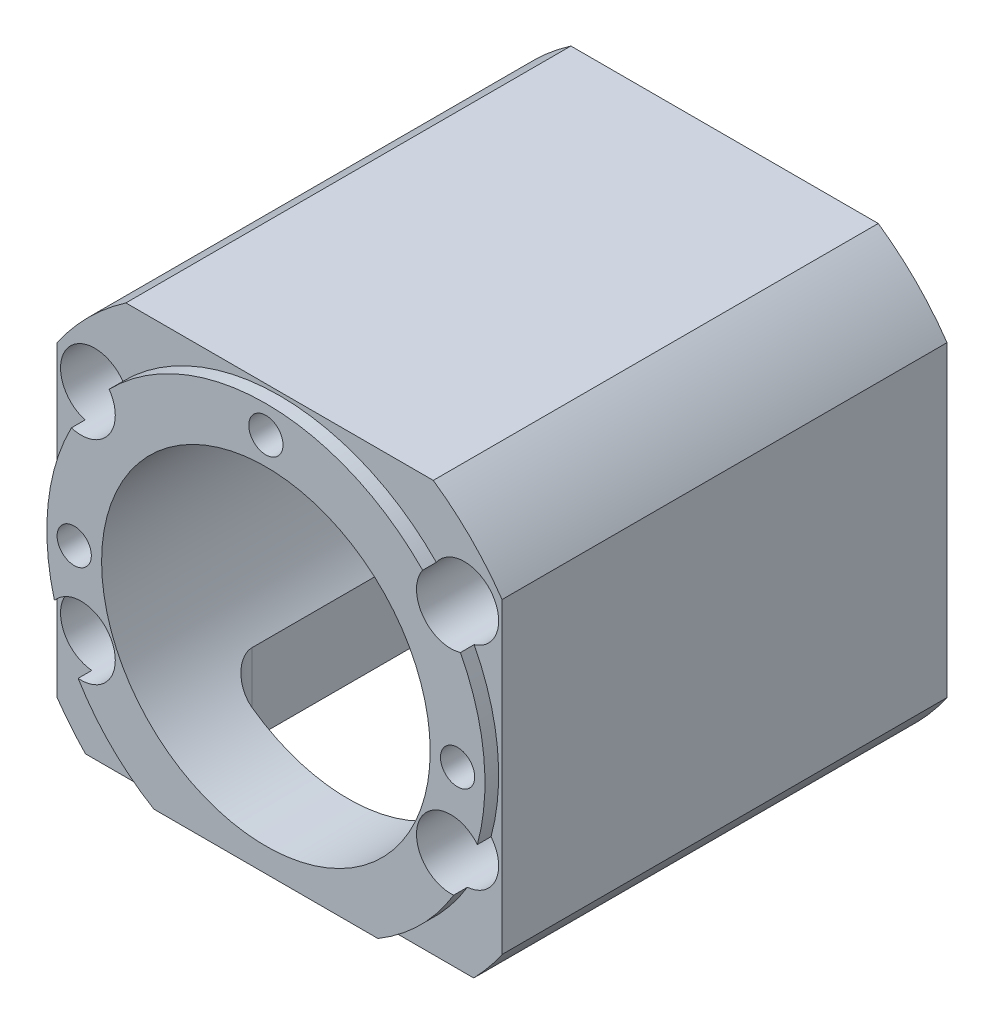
ISO-10303-21;
HEADER;
FILE_DESCRIPTION(('STEP AP214'),'2;1');
FILE_NAME('part.step','',(''),(''),'','','');
FILE_SCHEMA(('AUTOMOTIVE_DESIGN { 1 0 10303 214 1 1 1 1 }'));
ENDSEC;
DATA;
#1=APPLICATION_CONTEXT('core data for automotive mechanical design processes');
#2=APPLICATION_PROTOCOL_DEFINITION('international standard','automotive_design',2000,#1);
#3=PRODUCT_CONTEXT('',#1,'mechanical');
#4=PRODUCT('Part','Part','',(#3));
#5=PRODUCT_RELATED_PRODUCT_CATEGORY('part','',(#4));
#6=PRODUCT_DEFINITION_FORMATION('','',#4);
#7=PRODUCT_DEFINITION_CONTEXT('part definition',#1,'design');
#8=PRODUCT_DEFINITION('design','',#6,#7);
#9=PRODUCT_DEFINITION_SHAPE('','',#8);
#10=(LENGTH_UNIT() NAMED_UNIT(*) SI_UNIT(.MILLI.,.METRE.));
#11=(NAMED_UNIT(*) PLANE_ANGLE_UNIT() SI_UNIT($,.RADIAN.));
#12=(NAMED_UNIT(*) SI_UNIT($,.STERADIAN.) SOLID_ANGLE_UNIT());
#13=UNCERTAINTY_MEASURE_WITH_UNIT(LENGTH_MEASURE(1.E-05),#10,'distance_accuracy_value','');
#14=(GEOMETRIC_REPRESENTATION_CONTEXT(3) GLOBAL_UNCERTAINTY_ASSIGNED_CONTEXT((#13)) GLOBAL_UNIT_ASSIGNED_CONTEXT((#10,
#11,#12)) REPRESENTATION_CONTEXT('',''));
#15=CARTESIAN_POINT('',(0.,0.,0.));
#16=DIRECTION('',(0.,0.,1.));
#17=DIRECTION('',(1.,0.,0.));
#18=AXIS2_PLACEMENT_3D('',#15,#16,#17);
#19=CARTESIAN_POINT('',(25.0265826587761,3.98208852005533,65.));
#20=DIRECTION('',(0.,0.,1.));
#21=DIRECTION('',(1.,0.,0.));
#22=AXIS2_PLACEMENT_3D('',#19,#20,#21);
#23=CYLINDRICAL_SURFACE('',#22,32.);
#24=DIRECTION('',(0.,0.,1.));
#25=VECTOR('',#24,1.);
#26=CARTESIAN_POINT('',(8.66351448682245,-23.5179114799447,65.));
#27=LINE('',#26,#25);
#28=CARTESIAN_POINT('',(8.66351448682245,-23.5179114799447,67.));
#29=VERTEX_POINT('',#28);
#30=CARTESIAN_POINT('',(8.66351448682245,-23.5179114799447,65.));
#31=VERTEX_POINT('',#30);
#32=EDGE_CURVE('E416',#29,#31,#27,.F.);
#33=ORIENTED_EDGE('',*,*,#32,.F.);
#34=CARTESIAN_POINT('',(25.0265826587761,3.98208852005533,67.));
#35=DIRECTION('',(0.,0.,1.));
#36=DIRECTION('',(1.,0.,0.));
#37=AXIS2_PLACEMENT_3D('',#34,#35,#36);
#38=CIRCLE('',#37,32.);
#39=CARTESIAN_POINT('',(-2.40257259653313,-12.4994600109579,67.));
#40=VERTEX_POINT('',#39);
#41=EDGE_CURVE('E341',#40,#29,#38,.T.);
#42=ORIENTED_EDGE('',*,*,#41,.F.);
#43=DIRECTION('',(0.,0.,1.));
#44=VECTOR('',#43,1.);
#45=CARTESIAN_POINT('',(-2.40257259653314,-12.4994600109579,45.));
#46=LINE('',#45,#44);
#47=CARTESIAN_POINT('',(-2.40257259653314,-12.4994600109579,65.));
#48=VERTEX_POINT('',#47);
#49=EDGE_CURVE('E403',#48,#40,#46,.T.);
#50=ORIENTED_EDGE('',*,*,#49,.F.);
#51=CARTESIAN_POINT('',(25.0265826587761,3.98208852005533,65.));
#52=DIRECTION('',(0.,0.,1.));
#53=DIRECTION('',(1.,0.,0.));
#54=AXIS2_PLACEMENT_3D('',#51,#52,#53);
#55=CIRCLE('',#54,32.);
#56=EDGE_CURVE('E335',#48,#31,#55,.T.);
#57=ORIENTED_EDGE('',*,*,#56,.T.);
#58=EDGE_LOOP('',(#33,#42,#50,#57));
#59=FACE_BOUND('',#58,.T.);
#60=ADVANCED_FACE('F36',(#59),#23,.T.);
#61=DIRECTION('',(0.,0.,1.));
#62=VECTOR('',#61,1.);
#63=CARTESIAN_POINT('',(-3.39403872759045,18.6881512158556,45.));
#64=LINE('',#63,#62);
#65=CARTESIAN_POINT('',(-3.39403872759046,18.6881512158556,65.));
#66=VERTEX_POINT('',#65);
#67=CARTESIAN_POINT('',(-3.39403872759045,18.6881512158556,67.));
#68=VERTEX_POINT('',#67);
#69=EDGE_CURVE('E289',#66,#68,#64,.T.);
#70=ORIENTED_EDGE('',*,*,#69,.F.);
#71=CARTESIAN_POINT('',(-5.86269459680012,-4.37569531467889,65.));
#72=VERTEX_POINT('',#71);
#73=EDGE_CURVE('E344',#66,#72,#55,.T.);
#74=ORIENTED_EDGE('',*,*,#73,.T.);
#75=DIRECTION('',(0.,0.,1.));
#76=VECTOR('',#75,1.);
#77=CARTESIAN_POINT('',(-5.86269459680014,-4.37569531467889,45.));
#78=LINE('',#77,#76);
#79=CARTESIAN_POINT('',(-5.86269459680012,-4.37569531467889,67.));
#80=VERTEX_POINT('',#79);
#81=EDGE_CURVE('E400',#80,#72,#78,.F.);
#82=ORIENTED_EDGE('',*,*,#81,.F.);
#83=EDGE_CURVE('E334',#68,#80,#38,.T.);
#84=ORIENTED_EDGE('',*,*,#83,.F.);
#85=EDGE_LOOP('',(#70,#74,#82,#84));
#86=FACE_BOUND('',#85,.T.);
#87=ADVANCED_FACE('F489',(#86),#23,.T.);
#88=DIRECTION('',(0.,0.,1.));
#89=VECTOR('',#88,1.);
#90=CARTESIAN_POINT('',(2.13077402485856,26.3378919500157,45.));
#91=LINE('',#90,#89);
#92=CARTESIAN_POINT('',(2.13077402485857,26.3378919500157,67.));
#93=VERTEX_POINT('',#92);
#94=CARTESIAN_POINT('',(2.13077402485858,26.3378919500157,65.));
#95=VERTEX_POINT('',#94);
#96=EDGE_CURVE('E287',#93,#95,#91,.F.);
#97=ORIENTED_EDGE('',*,*,#96,.F.);
#98=CARTESIAN_POINT('',(47.9223912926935,26.3378919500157,67.));
#99=VERTEX_POINT('',#98);
#100=EDGE_CURVE('E535',#99,#93,#38,.T.);
#101=ORIENTED_EDGE('',*,*,#100,.F.);
#102=DIRECTION('',(0.,0.,1.));
#103=VECTOR('',#102,1.);
#104=CARTESIAN_POINT('',(47.9223912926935,26.3378919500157,45.));
#105=LINE('',#104,#103);
#106=CARTESIAN_POINT('',(47.9223912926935,26.3378919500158,65.));
#107=VERTEX_POINT('',#106);
#108=EDGE_CURVE('E304',#107,#99,#105,.T.);
#109=ORIENTED_EDGE('',*,*,#108,.F.);
#110=EDGE_CURVE('E549',#107,#95,#55,.T.);
#111=ORIENTED_EDGE('',*,*,#110,.T.);
#112=EDGE_LOOP('',(#97,#101,#109,#111));
#113=FACE_BOUND('',#112,.T.);
#114=ADVANCED_FACE('F495',(#113),#23,.T.);
#115=DIRECTION('',(0.,0.,1.));
#116=VECTOR('',#115,1.);
#117=CARTESIAN_POINT('',(53.4472040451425,18.6881512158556,45.));
#118=LINE('',#117,#116);
#119=CARTESIAN_POINT('',(53.4472040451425,18.6881512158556,67.));
#120=VERTEX_POINT('',#119);
#121=CARTESIAN_POINT('',(53.4472040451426,18.6881512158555,65.));
#122=VERTEX_POINT('',#121);
#123=EDGE_CURVE('E302',#120,#122,#118,.F.);
#124=ORIENTED_EDGE('',*,*,#123,.F.);
#125=CARTESIAN_POINT('',(55.9158599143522,-4.37569531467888,67.));
#126=VERTEX_POINT('',#125);
#127=EDGE_CURVE('E346',#126,#120,#38,.T.);
#128=ORIENTED_EDGE('',*,*,#127,.F.);
#129=DIRECTION('',(0.,0.,1.));
#130=VECTOR('',#129,1.);
#131=CARTESIAN_POINT('',(55.9158599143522,-4.37569531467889,45.));
#132=LINE('',#131,#130);
#133=CARTESIAN_POINT('',(55.9158599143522,-4.37569531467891,65.));
#134=VERTEX_POINT('',#133);
#135=EDGE_CURVE('E408',#134,#126,#132,.T.);
#136=ORIENTED_EDGE('',*,*,#135,.F.);
#137=EDGE_CURVE('E340',#134,#122,#55,.T.);
#138=ORIENTED_EDGE('',*,*,#137,.T.);
#139=EDGE_LOOP('',(#124,#128,#136,#138));
#140=FACE_BOUND('',#139,.T.);
#141=ADVANCED_FACE('F502',(#140),#23,.T.);
#142=CARTESIAN_POINT('',(25.0265826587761,3.98208852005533,67.));
#143=DIRECTION('',(0.,0.,1.));
#144=DIRECTION('',(1.,0.,0.));
#145=AXIS2_PLACEMENT_3D('',#142,#143,#144);
#146=PLANE('',#145);
#147=CARTESIAN_POINT('',(-2.97341734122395,3.98208852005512,67.));
#148=DIRECTION('',(0.,0.,1.));
#149=DIRECTION('',(1.,0.,0.));
#150=AXIS2_PLACEMENT_3D('',#147,#148,#149);
#151=CIRCLE('',#150,2.5);
#152=CARTESIAN_POINT('',(-0.473417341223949,3.98208852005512,67.));
#153=VERTEX_POINT('',#152);
#154=EDGE_CURVE('E922',#153,#153,#151,.T.);
#155=ORIENTED_EDGE('',*,*,#154,.F.);
#156=EDGE_LOOP('',(#155));
#157=FACE_BOUND('',#156,.T.);
#158=CARTESIAN_POINT('',(25.0265826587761,31.9820885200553,67.));
#159=DIRECTION('',(0.,0.,1.));
#160=DIRECTION('',(1.,0.,0.));
#161=AXIS2_PLACEMENT_3D('',#158,#159,#160);
#162=CIRCLE('',#161,2.5);
#163=CARTESIAN_POINT('',(27.5265826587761,31.9820885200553,67.));
#164=VERTEX_POINT('',#163);
#165=EDGE_CURVE('E231',#164,#164,#162,.T.);
#166=ORIENTED_EDGE('',*,*,#165,.F.);
#167=EDGE_LOOP('',(#166));
#168=FACE_BOUND('',#167,.T.);
#169=CARTESIAN_POINT('',(53.0265826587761,3.98208852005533,67.));
#170=DIRECTION('',(0.,0.,1.));
#171=DIRECTION('',(1.,0.,0.));
#172=AXIS2_PLACEMENT_3D('',#169,#170,#171);
#173=CIRCLE('',#172,2.5);
#174=CARTESIAN_POINT('',(55.526582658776,3.98208852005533,67.));
#175=VERTEX_POINT('',#174);
#176=EDGE_CURVE('E250',#175,#175,#173,.T.);
#177=ORIENTED_EDGE('',*,*,#176,.F.);
#178=EDGE_LOOP('',(#177));
#179=FACE_BOUND('',#178,.T.);
#180=DIRECTION('',(-1.,0.,0.));
#181=VECTOR('',#180,1.);
#182=CARTESIAN_POINT('',(25.0265826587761,-23.5179114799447,67.));
#183=LINE('',#182,#181);
#184=CARTESIAN_POINT('',(41.3896508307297,-23.5179114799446,67.));
#185=VERTEX_POINT('',#184);
#186=EDGE_CURVE('E268',#185,#29,#183,.T.);
#187=ORIENTED_EDGE('',*,*,#186,.F.);
#188=CARTESIAN_POINT('',(52.4557379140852,-12.4994600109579,67.));
#189=VERTEX_POINT('',#188);
#190=EDGE_CURVE('E345',#185,#189,#38,.T.);
#191=ORIENTED_EDGE('',*,*,#190,.T.);
#192=CARTESIAN_POINT('',(52.0265826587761,-7.51791147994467,67.));
#193=DIRECTION('',(0.,0.,1.));
#194=DIRECTION('',(1.,0.,0.));
#195=AXIS2_PLACEMENT_3D('',#192,#193,#194);
#196=CIRCLE('',#195,4.99999999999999);
#197=EDGE_CURVE('E306',#126,#189,#196,.T.);
#198=ORIENTED_EDGE('',*,*,#197,.F.);
#199=ORIENTED_EDGE('',*,*,#127,.T.);
#200=CARTESIAN_POINT('',(52.0265826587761,23.4820885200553,67.));
#201=DIRECTION('',(0.,0.,1.));
#202=DIRECTION('',(1.,0.,0.));
#203=AXIS2_PLACEMENT_3D('',#200,#201,#202);
#204=CIRCLE('',#203,4.99999999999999);
#205=EDGE_CURVE('E291',#99,#120,#204,.T.);
#206=ORIENTED_EDGE('',*,*,#205,.F.);
#207=ORIENTED_EDGE('',*,*,#100,.T.);
#208=CARTESIAN_POINT('',(-1.97341734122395,23.4820885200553,67.));
#209=DIRECTION('',(0.,0.,1.));
#210=DIRECTION('',(1.,0.,0.));
#211=AXIS2_PLACEMENT_3D('',#208,#209,#210);
#212=CIRCLE('',#211,4.99999999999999);
#213=EDGE_CURVE('E276',#68,#93,#212,.T.);
#214=ORIENTED_EDGE('',*,*,#213,.F.);
#215=ORIENTED_EDGE('',*,*,#83,.T.);
#216=CARTESIAN_POINT('',(-1.97341734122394,-7.51791147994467,67.));
#217=DIRECTION('',(0.,0.,1.));
#218=DIRECTION('',(1.,0.,0.));
#219=AXIS2_PLACEMENT_3D('',#216,#217,#218);
#220=CIRCLE('',#219,4.99999999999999);
#221=EDGE_CURVE('E320',#40,#80,#220,.T.);
#222=ORIENTED_EDGE('',*,*,#221,.F.);
#223=ORIENTED_EDGE('',*,*,#41,.T.);
#224=EDGE_LOOP('',(#187,#191,#198,#199,#206,#207,#214,#215,#222,#223));
#225=FACE_BOUND('',#224,.T.);
#226=CARTESIAN_POINT('',(25.0265826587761,3.98208852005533,67.));
#227=DIRECTION('',(0.,0.,1.));
#228=DIRECTION('',(1.,0.,0.));
#229=AXIS2_PLACEMENT_3D('',#226,#227,#228);
#230=CIRCLE('',#229,24.);
#231=CARTESIAN_POINT('',(49.0265826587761,3.98208852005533,67.));
#232=VERTEX_POINT('',#231);
#233=EDGE_CURVE('E360',#232,#232,#230,.T.);
#234=ORIENTED_EDGE('',*,*,#233,.F.);
#235=EDGE_LOOP('',(#234));
#236=FACE_BOUND('',#235,.T.);
#237=ADVANCED_FACE('F460',(#157,#168,#179,#225,#236),#146,.T.);
#238=CARTESIAN_POINT('',(25.0265826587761,3.98208852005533,67.));
#239=DIRECTION('',(0.,0.,-1.));
#240=DIRECTION('',(-1.,0.,0.));
#241=AXIS2_PLACEMENT_3D('',#238,#239,#240);
#242=CYLINDRICAL_SURFACE('',#241,39.5);
#243=CARTESIAN_POINT('',(25.0265826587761,3.98208852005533,65.));
#244=DIRECTION('',(0.,0.,1.));
#245=DIRECTION('',(1.,0.,0.));
#246=AXIS2_PLACEMENT_3D('',#243,#244,#245);
#247=CIRCLE('',#246,39.5);
#248=CARTESIAN_POINT('',(57.526582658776,26.432032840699,65.));
#249=VERTEX_POINT('',#248);
#250=CARTESIAN_POINT('',(47.4765269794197,36.4820885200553,65.));
#251=VERTEX_POINT('',#250);
#252=EDGE_CURVE('E357',#249,#251,#247,.T.);
#253=ORIENTED_EDGE('',*,*,#252,.F.);
#254=DIRECTION('',(0.,0.,-1.));
#255=VECTOR('',#254,1.);
#256=CARTESIAN_POINT('',(57.526582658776,26.432032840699,67.));
#257=LINE('',#256,#255);
#258=CARTESIAN_POINT('',(57.526582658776,26.432032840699,0.));
#259=VERTEX_POINT('',#258);
#260=EDGE_CURVE('E385',#249,#259,#257,.T.);
#261=ORIENTED_EDGE('',*,*,#260,.T.);
#262=CARTESIAN_POINT('',(25.0265826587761,3.98208852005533,0.));
#263=DIRECTION('',(0.,0.,1.));
#264=DIRECTION('',(1.,0.,0.));
#265=AXIS2_PLACEMENT_3D('',#262,#263,#264);
#266=CIRCLE('',#265,39.5);
#267=CARTESIAN_POINT('',(47.4765269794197,36.4820885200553,0.));
#268=VERTEX_POINT('',#267);
#269=EDGE_CURVE('E363',#259,#268,#266,.T.);
#270=ORIENTED_EDGE('',*,*,#269,.T.);
#271=DIRECTION('',(0.,0.,-1.));
#272=VECTOR('',#271,1.);
#273=CARTESIAN_POINT('',(47.4765269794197,36.4820885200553,67.));
#274=LINE('',#273,#272);
#275=EDGE_CURVE('E396',#251,#268,#274,.T.);
#276=ORIENTED_EDGE('',*,*,#275,.F.);
#277=EDGE_LOOP('',(#253,#261,#270,#276));
#278=FACE_BOUND('',#277,.T.);
#279=ADVANCED_FACE('F517',(#278),#242,.T.);
#280=CARTESIAN_POINT('',(2.5766383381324,36.4820885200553,67.));
#281=DIRECTION('',(0.,-1.,0.));
#282=DIRECTION('',(0.,0.,-1.));
#283=AXIS2_PLACEMENT_3D('',#280,#281,#282);
#284=PLANE('',#283);
#285=DIRECTION('',(-1.,0.,0.));
#286=VECTOR('',#285,1.);
#287=CARTESIAN_POINT('',(2.5766383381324,36.4820885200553,65.));
#288=LINE('',#287,#286);
#289=CARTESIAN_POINT('',(2.57663833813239,36.4820885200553,65.));
#290=VERTEX_POINT('',#289);
#291=EDGE_CURVE('E355',#251,#290,#288,.T.);
#292=ORIENTED_EDGE('',*,*,#291,.F.);
#293=ORIENTED_EDGE('',*,*,#275,.T.);
#294=DIRECTION('',(-1.,0.,0.));
#295=VECTOR('',#294,1.);
#296=CARTESIAN_POINT('',(2.5766383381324,36.4820885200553,0.));
#297=LINE('',#296,#295);
#298=CARTESIAN_POINT('',(2.57663833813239,36.4820885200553,0.));
#299=VERTEX_POINT('',#298);
#300=EDGE_CURVE('E368',#268,#299,#297,.T.);
#301=ORIENTED_EDGE('',*,*,#300,.T.);
#302=DIRECTION('',(0.,0.,-1.));
#303=VECTOR('',#302,1.);
#304=CARTESIAN_POINT('',(2.57663833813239,36.4820885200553,67.));
#305=LINE('',#304,#303);
#306=EDGE_CURVE('E394',#290,#299,#305,.T.);
#307=ORIENTED_EDGE('',*,*,#306,.F.);
#308=EDGE_LOOP('',(#292,#293,#301,#307));
#309=FACE_BOUND('',#308,.T.);
#310=ADVANCED_FACE('F980',(#309),#284,.F.);
#311=CARTESIAN_POINT('',(25.0265826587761,3.98208852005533,67.));
#312=DIRECTION('',(0.,0.,-1.));
#313=DIRECTION('',(-1.,0.,0.));
#314=AXIS2_PLACEMENT_3D('',#311,#312,#313);
#315=CYLINDRICAL_SURFACE('',#314,39.5);
#316=CARTESIAN_POINT('',(25.0265826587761,3.98208852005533,65.));
#317=DIRECTION('',(0.,0.,1.));
#318=DIRECTION('',(1.,0.,0.));
#319=AXIS2_PLACEMENT_3D('',#316,#317,#318);
#320=CIRCLE('',#319,39.5);
#321=CARTESIAN_POINT('',(-7.47341734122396,26.432032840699,65.));
#322=VERTEX_POINT('',#321);
#323=EDGE_CURVE('E353',#290,#322,#320,.T.);
#324=ORIENTED_EDGE('',*,*,#323,.F.);
#325=ORIENTED_EDGE('',*,*,#306,.T.);
#326=CARTESIAN_POINT('',(25.0265826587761,3.98208852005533,0.));
#327=DIRECTION('',(0.,0.,1.));
#328=DIRECTION('',(1.,0.,0.));
#329=AXIS2_PLACEMENT_3D('',#326,#327,#328);
#330=CIRCLE('',#329,39.5);
#331=CARTESIAN_POINT('',(-7.47341734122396,26.432032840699,0.));
#332=VERTEX_POINT('',#331);
#333=EDGE_CURVE('E371',#299,#332,#330,.T.);
#334=ORIENTED_EDGE('',*,*,#333,.T.);
#335=DIRECTION('',(0.,0.,-1.));
#336=VECTOR('',#335,1.);
#337=CARTESIAN_POINT('',(-7.47341734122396,26.432032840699,67.));
#338=LINE('',#337,#336);
#339=EDGE_CURVE('E392',#322,#332,#338,.T.);
#340=ORIENTED_EDGE('',*,*,#339,.F.);
#341=EDGE_LOOP('',(#324,#325,#334,#340));
#342=FACE_BOUND('',#341,.T.);
#343=ADVANCED_FACE('F987',(#342),#315,.T.);
#344=CARTESIAN_POINT('',(-7.47341734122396,26.432032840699,67.));
#345=DIRECTION('',(1.,0.,0.));
#346=DIRECTION('',(0.,1.,0.));
#347=AXIS2_PLACEMENT_3D('',#344,#345,#346);
#348=PLANE('',#347);
#349=DIRECTION('',(0.,-1.,0.));
#350=VECTOR('',#349,1.);
#351=CARTESIAN_POINT('',(-7.47341734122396,26.432032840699,65.));
#352=LINE('',#351,#350);
#353=CARTESIAN_POINT('',(-7.47341734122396,-18.4678558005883,65.));
#354=VERTEX_POINT('',#353);
#355=EDGE_CURVE('E351',#322,#354,#352,.T.);
#356=ORIENTED_EDGE('',*,*,#355,.F.);
#357=ORIENTED_EDGE('',*,*,#339,.T.);
#358=DIRECTION('',(0.,-1.,0.));
#359=VECTOR('',#358,1.);
#360=CARTESIAN_POINT('',(-7.47341734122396,26.432032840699,0.));
#361=LINE('',#360,#359);
#362=CARTESIAN_POINT('',(-7.47341734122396,-18.4678558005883,0.));
#363=VERTEX_POINT('',#362);
#364=EDGE_CURVE('E374',#332,#363,#361,.T.);
#365=ORIENTED_EDGE('',*,*,#364,.T.);
#366=DIRECTION('',(0.,0.,-1.));
#367=VECTOR('',#366,1.);
#368=CARTESIAN_POINT('',(-7.47341734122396,-18.4678558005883,67.));
#369=LINE('',#368,#367);
#370=EDGE_CURVE('E390',#354,#363,#369,.T.);
#371=ORIENTED_EDGE('',*,*,#370,.F.);
#372=EDGE_LOOP('',(#356,#357,#365,#371));
#373=FACE_BOUND('',#372,.T.);
#374=ADVANCED_FACE('F676',(#373),#348,.F.);
#375=CARTESIAN_POINT('',(25.0265826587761,3.98208852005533,67.));
#376=DIRECTION('',(0.,0.,-1.));
#377=DIRECTION('',(-1.,0.,0.));
#378=AXIS2_PLACEMENT_3D('',#375,#376,#377);
#379=CYLINDRICAL_SURFACE('',#378,39.5);
#380=CARTESIAN_POINT('',(25.0265826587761,3.98208852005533,0.));
#381=DIRECTION('',(0.,0.,1.));
#382=DIRECTION('',(1.,0.,0.));
#383=AXIS2_PLACEMENT_3D('',#380,#381,#382);
#384=CIRCLE('',#383,39.5);
#385=CARTESIAN_POINT('',(-3.32831109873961,-23.5179114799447,0.));
#386=VERTEX_POINT('',#385);
#387=EDGE_CURVE('E377',#363,#386,#384,.T.);
#388=ORIENTED_EDGE('',*,*,#387,.T.);
#389=DIRECTION('',(0.,0.,-1.));
#390=VECTOR('',#389,1.);
#391=CARTESIAN_POINT('',(-3.32831109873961,-23.5179114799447,67.));
#392=LINE('',#391,#390);
#393=CARTESIAN_POINT('',(-3.32831109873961,-23.5179114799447,65.));
#394=VERTEX_POINT('',#393);
#395=EDGE_CURVE('E273',#386,#394,#392,.F.);
#396=ORIENTED_EDGE('',*,*,#395,.T.);
#397=CARTESIAN_POINT('',(25.0265826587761,3.98208852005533,65.));
#398=DIRECTION('',(0.,0.,1.));
#399=DIRECTION('',(1.,0.,0.));
#400=AXIS2_PLACEMENT_3D('',#397,#398,#399);
#401=CIRCLE('',#400,39.5);
#402=EDGE_CURVE('E348',#354,#394,#401,.T.);
#403=ORIENTED_EDGE('',*,*,#402,.F.);
#404=ORIENTED_EDGE('',*,*,#370,.T.);
#405=EDGE_LOOP('',(#388,#396,#403,#404));
#406=FACE_BOUND('',#405,.T.);
#407=ADVANCED_FACE('F670',(#406),#379,.T.);
#408=CARTESIAN_POINT('',(25.0265826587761,3.98208852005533,67.));
#409=DIRECTION('',(0.,0.,-1.));
#410=DIRECTION('',(-1.,0.,0.));
#411=AXIS2_PLACEMENT_3D('',#408,#409,#410);
#412=CYLINDRICAL_SURFACE('',#411,39.5);
#413=CARTESIAN_POINT('',(25.0265826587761,3.98208852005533,65.));
#414=DIRECTION('',(0.,0.,1.));
#415=DIRECTION('',(1.,0.,0.));
#416=AXIS2_PLACEMENT_3D('',#413,#414,#415);
#417=CIRCLE('',#416,39.5);
#418=CARTESIAN_POINT('',(53.3814764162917,-23.5179114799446,65.));
#419=VERTEX_POINT('',#418);
#420=CARTESIAN_POINT('',(57.526582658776,-18.4678558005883,65.));
#421=VERTEX_POINT('',#420);
#422=EDGE_CURVE('E338',#419,#421,#417,.T.);
#423=ORIENTED_EDGE('',*,*,#422,.F.);
#424=DIRECTION('',(0.,0.,-1.));
#425=VECTOR('',#424,1.);
#426=CARTESIAN_POINT('',(53.3814764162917,-23.5179114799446,67.));
#427=LINE('',#426,#425);
#428=CARTESIAN_POINT('',(53.3814764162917,-23.5179114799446,0.));
#429=VERTEX_POINT('',#428);
#430=EDGE_CURVE('E264',#419,#429,#427,.T.);
#431=ORIENTED_EDGE('',*,*,#430,.T.);
#432=CARTESIAN_POINT('',(25.0265826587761,3.98208852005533,0.));
#433=DIRECTION('',(0.,0.,1.));
#434=DIRECTION('',(1.,0.,0.));
#435=AXIS2_PLACEMENT_3D('',#432,#433,#434);
#436=CIRCLE('',#435,39.5);
#437=CARTESIAN_POINT('',(57.526582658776,-18.4678558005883,0.));
#438=VERTEX_POINT('',#437);
#439=EDGE_CURVE('E380',#429,#438,#436,.T.);
#440=ORIENTED_EDGE('',*,*,#439,.T.);
#441=DIRECTION('',(0.,0.,-1.));
#442=VECTOR('',#441,1.);
#443=CARTESIAN_POINT('',(57.526582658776,-18.4678558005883,67.));
#444=LINE('',#443,#442);
#445=EDGE_CURVE('E387',#421,#438,#444,.T.);
#446=ORIENTED_EDGE('',*,*,#445,.F.);
#447=EDGE_LOOP('',(#423,#431,#440,#446));
#448=FACE_BOUND('',#447,.T.);
#449=ADVANCED_FACE('F675',(#448),#412,.T.);
#450=CARTESIAN_POINT('',(57.526582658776,26.432032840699,67.));
#451=DIRECTION('',(-1.,0.,0.));
#452=DIRECTION('',(0.,-1.,0.));
#453=AXIS2_PLACEMENT_3D('',#450,#451,#452);
#454=PLANE('',#453);
#455=DIRECTION('',(0.,1.,0.));
#456=VECTOR('',#455,1.);
#457=CARTESIAN_POINT('',(57.526582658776,26.432032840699,65.));
#458=LINE('',#457,#456);
#459=EDGE_CURVE('E398',#421,#249,#458,.T.);
#460=ORIENTED_EDGE('',*,*,#459,.F.);
#461=ORIENTED_EDGE('',*,*,#445,.T.);
#462=DIRECTION('',(0.,1.,0.));
#463=VECTOR('',#462,1.);
#464=CARTESIAN_POINT('',(57.526582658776,26.432032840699,0.));
#465=LINE('',#464,#463);
#466=EDGE_CURVE('E382',#438,#259,#465,.T.);
#467=ORIENTED_EDGE('',*,*,#466,.T.);
#468=ORIENTED_EDGE('',*,*,#260,.F.);
#469=EDGE_LOOP('',(#460,#461,#467,#468));
#470=FACE_BOUND('',#469,.T.);
#471=ADVANCED_FACE('F688',(#470),#454,.F.);
#472=CARTESIAN_POINT('',(25.0265826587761,3.98208852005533,0.));
#473=DIRECTION('',(0.,0.,1.));
#474=DIRECTION('',(1.,0.,0.));
#475=AXIS2_PLACEMENT_3D('',#472,#473,#474);
#476=PLANE('',#475);
#477=CARTESIAN_POINT('',(-1.97341734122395,23.4820885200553,0.));
#478=DIRECTION('',(0.,0.,1.));
#479=DIRECTION('',(1.,0.,0.));
#480=AXIS2_PLACEMENT_3D('',#477,#478,#479);
#481=CIRCLE('',#480,2.74999999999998);
#482=CARTESIAN_POINT('',(0.776582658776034,23.4820885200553,0.));
#483=VERTEX_POINT('',#482);
#484=EDGE_CURVE('E284',#483,#483,#481,.T.);
#485=ORIENTED_EDGE('',*,*,#484,.T.);
#486=EDGE_LOOP('',(#485));
#487=FACE_BOUND('',#486,.T.);
#488=CARTESIAN_POINT('',(52.0265826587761,23.4820885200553,0.));
#489=DIRECTION('',(0.,0.,1.));
#490=DIRECTION('',(1.,0.,0.));
#491=AXIS2_PLACEMENT_3D('',#488,#489,#490);
#492=CIRCLE('',#491,2.74999999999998);
#493=CARTESIAN_POINT('',(54.776582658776,23.4820885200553,0.));
#494=VERTEX_POINT('',#493);
#495=EDGE_CURVE('E299',#494,#494,#492,.T.);
#496=ORIENTED_EDGE('',*,*,#495,.T.);
#497=EDGE_LOOP('',(#496));
#498=FACE_BOUND('',#497,.T.);
#499=CARTESIAN_POINT('',(52.0265826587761,-7.51791147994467,0.));
#500=DIRECTION('',(0.,0.,1.));
#501=DIRECTION('',(1.,0.,0.));
#502=AXIS2_PLACEMENT_3D('',#499,#500,#501);
#503=CIRCLE('',#502,2.74999999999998);
#504=CARTESIAN_POINT('',(54.776582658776,-7.51791147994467,0.));
#505=VERTEX_POINT('',#504);
#506=EDGE_CURVE('E315',#505,#505,#503,.T.);
#507=ORIENTED_EDGE('',*,*,#506,.T.);
#508=EDGE_LOOP('',(#507));
#509=FACE_BOUND('',#508,.T.);
#510=CARTESIAN_POINT('',(-1.97341734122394,-7.51791147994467,0.));
#511=DIRECTION('',(0.,0.,1.));
#512=DIRECTION('',(1.,0.,0.));
#513=AXIS2_PLACEMENT_3D('',#510,#511,#512);
#514=CIRCLE('',#513,2.74999999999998);
#515=CARTESIAN_POINT('',(0.776582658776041,-7.51791147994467,0.));
#516=VERTEX_POINT('',#515);
#517=EDGE_CURVE('E329',#516,#516,#514,.T.);
#518=ORIENTED_EDGE('',*,*,#517,.T.);
#519=EDGE_LOOP('',(#518));
#520=FACE_BOUND('',#519,.T.);
#521=ORIENTED_EDGE('',*,*,#439,.F.);
#522=DIRECTION('',(-1.,0.,0.));
#523=VECTOR('',#522,1.);
#524=CARTESIAN_POINT('',(25.0265826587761,-23.5179114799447,0.));
#525=LINE('',#524,#523);
#526=EDGE_CURVE('E270',#429,#386,#525,.T.);
#527=ORIENTED_EDGE('',*,*,#526,.T.);
#528=ORIENTED_EDGE('',*,*,#387,.F.);
#529=ORIENTED_EDGE('',*,*,#364,.F.);
#530=ORIENTED_EDGE('',*,*,#333,.F.);
#531=ORIENTED_EDGE('',*,*,#300,.F.);
#532=ORIENTED_EDGE('',*,*,#269,.F.);
#533=ORIENTED_EDGE('',*,*,#466,.F.);
#534=EDGE_LOOP('',(#521,#527,#528,#529,#530,#531,#532,#533));
#535=FACE_BOUND('',#534,.T.);
#536=CARTESIAN_POINT('',(25.0265826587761,3.98208852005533,0.));
#537=DIRECTION('',(0.,0.,1.));
#538=DIRECTION('',(1.,0.,0.));
#539=AXIS2_PLACEMENT_3D('',#536,#537,#538);
#540=CIRCLE('',#539,24.);
#541=CARTESIAN_POINT('',(49.0265826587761,3.98208852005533,0.));
#542=VERTEX_POINT('',#541);
#543=EDGE_CURVE('E359',#542,#542,#540,.T.);
#544=ORIENTED_EDGE('',*,*,#543,.T.);
#545=EDGE_LOOP('',(#544));
#546=FACE_BOUND('',#545,.T.);
#547=ADVANCED_FACE('F457',(#487,#498,#509,#520,#535,#546),#476,.F.);
#548=CARTESIAN_POINT('',(25.0265826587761,3.98208852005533,67.));
#549=DIRECTION('',(0.,0.,-1.));
#550=DIRECTION('',(-1.,0.,0.));
#551=AXIS2_PLACEMENT_3D('',#548,#549,#550);
#552=CYLINDRICAL_SURFACE('',#551,24.);
#553=DIRECTION('',(0.,0.,-1.));
#554=VECTOR('',#553,1.);
#555=CARTESIAN_POINT('',(43.0265826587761,-11.8924193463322,67.));
#556=LINE('',#555,#554);
#557=CARTESIAN_POINT('',(43.0265826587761,-11.8924193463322,51.));
#558=VERTEX_POINT('',#557);
#559=CARTESIAN_POINT('',(43.0265826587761,-11.8924193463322,16.));
#560=VERTEX_POINT('',#559);
#561=EDGE_CURVE('E916',#558,#560,#556,.T.);
#562=ORIENTED_EDGE('',*,*,#561,.F.);
#563=CARTESIAN_POINT('',(43.026582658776,-11.8924193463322,51.));
#564=CARTESIAN_POINT('',(43.0266080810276,-11.8923831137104,51.0884099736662));
#565=CARTESIAN_POINT('',(43.0236525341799,-11.8957416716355,51.1767939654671));
#566=CARTESIAN_POINT('',(43.0119783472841,-11.9089681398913,51.3525864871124));
#567=CARTESIAN_POINT('',(43.0032666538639,-11.9188282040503,51.4399960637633));
#568=CARTESIAN_POINT('',(42.9804053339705,-11.9446351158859,51.6121752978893));
#569=CARTESIAN_POINT('',(42.9663169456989,-11.9605134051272,51.6969634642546));
#570=CARTESIAN_POINT('',(42.9330312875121,-11.9978904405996,51.8642583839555));
#571=CARTESIAN_POINT('',(42.9138327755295,-12.0193905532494,51.9467645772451));
#572=CARTESIAN_POINT('',(42.8493328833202,-12.0912962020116,52.1892915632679));
#573=CARTESIAN_POINT('',(42.7969926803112,-12.149261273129,52.345284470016));
#574=CARTESIAN_POINT('',(42.676595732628,-12.2809073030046,52.6442509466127));
#575=CARTESIAN_POINT('',(42.6084899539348,-12.3546372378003,52.7871819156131));
#576=CARTESIAN_POINT('',(42.4203794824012,-12.5552358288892,53.1302272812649));
#577=CARTESIAN_POINT('',(42.2918402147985,-12.6897540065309,53.3212501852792));
#578=CARTESIAN_POINT('',(42.0820484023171,-12.9034453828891,53.5839402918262));
#579=CARTESIAN_POINT('',(42.0091607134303,-12.9767848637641,53.6676410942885));
#580=CARTESIAN_POINT('',(41.8582625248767,-13.1265587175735,53.8273024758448));
#581=CARTESIAN_POINT('',(41.7802534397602,-13.2029922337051,53.9032651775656));
#582=CARTESIAN_POINT('',(41.594308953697,-13.3825879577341,54.070334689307));
#583=CARTESIAN_POINT('',(41.4846881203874,-13.4865845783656,54.1586729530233));
#584=CARTESIAN_POINT('',(41.2584121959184,-13.6970427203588,54.322415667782));
#585=CARTESIAN_POINT('',(41.1417547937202,-13.8035050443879,54.3978158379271));
#586=CARTESIAN_POINT('',(40.7825301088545,-14.124613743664,54.6045756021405));
#587=CARTESIAN_POINT('',(40.5303808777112,-14.3413032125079,54.7167856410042));
#588=CARTESIAN_POINT('',(40.0706857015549,-14.7192731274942,54.8669301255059));
#589=CARTESIAN_POINT('',(39.8672699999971,-14.8811715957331,54.9163076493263));
#590=CARTESIAN_POINT('',(39.5560109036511,-15.1206030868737,54.9661970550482));
#591=CARTESIAN_POINT('',(39.4513129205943,-15.1997883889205,54.9787969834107));
#592=CARTESIAN_POINT('',(39.2401614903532,-15.3567725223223,54.9956974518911));
#593=CARTESIAN_POINT('',(39.1337073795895,-15.434570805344,54.9999947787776));
#594=CARTESIAN_POINT('',(39.026582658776,-15.5115001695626,55.));
#595=B_SPLINE_CURVE_WITH_KNOTS('',3,(#563,#564,#565,#566,#567,#568,#569,#570,#571,#572,#573,
#574,#575,#576,#577,#578,#579,#580,#581,#582,#583,#584,#585,#586,#587,#588,#589,#590,#591,#592,
#593,#594),.UNSPECIFIED.,.F.,.F.,(4,2,2,2,2,2,2,2,2,2,2,2,2,2,2,4),(0.,0.265074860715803,
0.529830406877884,0.791656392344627,1.05354607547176,1.5744103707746,2.09691695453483,
2.89214267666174,3.29099764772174,3.68974291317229,4.21411172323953,4.73865370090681,
5.7861231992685,6.57799026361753,6.97335447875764,7.36887167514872),.UNSPECIFIED.);
#596=CARTESIAN_POINT('',(39.026582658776,-15.5115001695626,55.));
#597=VERTEX_POINT('',#596);
#598=EDGE_CURVE('E439',#558,#597,#595,.T.);
#599=ORIENTED_EDGE('',*,*,#598,.T.);
#600=CARTESIAN_POINT('',(25.0265826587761,3.98208852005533,55.));
#601=DIRECTION('',(0.,0.,1.));
#602=DIRECTION('',(1.,0.,0.));
#603=AXIS2_PLACEMENT_3D('',#600,#601,#602);
#604=CIRCLE('',#603,24.);
#605=CARTESIAN_POINT('',(11.0265826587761,-15.5115001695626,55.));
#606=VERTEX_POINT('',#605);
#607=EDGE_CURVE('E942',#606,#597,#604,.T.);
#608=ORIENTED_EDGE('',*,*,#607,.F.);
#609=CARTESIAN_POINT('',(11.0265826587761,-15.5115001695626,55.));
#610=CARTESIAN_POINT('',(10.8889353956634,-15.4126633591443,54.9999859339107));
#611=CARTESIAN_POINT('',(10.7523910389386,-15.3123710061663,54.9928960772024));
#612=CARTESIAN_POINT('',(10.482379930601,-15.1096493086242,54.9651332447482));
#613=CARTESIAN_POINT('',(10.3489119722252,-15.0072208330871,54.9444656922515));
#614=CARTESIAN_POINT('',(10.0852905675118,-14.800510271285,54.8900068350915));
#615=CARTESIAN_POINT('',(9.95515243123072,-14.6962224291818,54.8561636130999));
#616=CARTESIAN_POINT('',(9.69941503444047,-14.4869456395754,54.7757908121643));
#617=CARTESIAN_POINT('',(9.57381634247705,-14.3819566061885,54.7292596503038));
#618=CARTESIAN_POINT('',(9.32360445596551,-14.1685156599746,54.6220189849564));
#619=CARTESIAN_POINT('',(9.19917171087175,-14.0600680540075,54.5608791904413));
#620=CARTESIAN_POINT('',(8.95654739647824,-13.8443055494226,54.4255299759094));
#621=CARTESIAN_POINT('',(8.8383566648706,-13.7369908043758,54.3513188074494));
#622=CARTESIAN_POINT('',(8.60914162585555,-13.5248236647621,54.1899219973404));
#623=CARTESIAN_POINT('',(8.49810823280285,-13.4199682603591,54.1027532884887));
#624=CARTESIAN_POINT('',(8.28401977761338,-13.2140927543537,53.9152335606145));
#625=CARTESIAN_POINT('',(8.18096097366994,-13.1130708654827,53.814888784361));
#626=CARTESIAN_POINT('',(7.95275535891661,-12.8855679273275,53.5667703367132));
#627=CARTESIAN_POINT('',(7.83090249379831,-12.761114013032,53.4140227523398));
#628=CARTESIAN_POINT('',(7.60671371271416,-12.5277352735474,53.084255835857));
#629=CARTESIAN_POINT('',(7.50434738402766,-12.4187863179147,52.9072750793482));
#630=CARTESIAN_POINT('',(7.34554503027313,-12.2472449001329,52.5734240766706));
#631=CARTESIAN_POINT('',(7.283966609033,-12.1797709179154,52.4215426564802));
#632=CARTESIAN_POINT('',(7.17871205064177,-12.0634620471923,52.1052167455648));
#633=CARTESIAN_POINT('',(7.13498372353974,-12.0145728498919,51.9408105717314));
#634=CARTESIAN_POINT('',(7.07720405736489,-11.9496777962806,51.6469863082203));
#635=CARTESIAN_POINT('',(7.05838073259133,-11.9284142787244,51.5196740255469));
#636=CARTESIAN_POINT('',(7.03938629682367,-11.9069281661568,51.3263442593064));
#637=CARTESIAN_POINT('',(7.03459456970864,-11.9015005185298,51.2613143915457));
#638=CARTESIAN_POINT('',(7.02818924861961,-11.894241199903,51.1308635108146));
#639=CARTESIAN_POINT('',(7.02657739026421,-11.8924114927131,51.0654423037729));
#640=CARTESIAN_POINT('',(7.02658265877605,-11.8924193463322,51.));
#641=B_SPLINE_CURVE_WITH_KNOTS('',3,(#609,#610,#611,#612,#613,#614,#615,#616,#617,#618,#619,
#620,#621,#622,#623,#624,#625,#626,#627,#628,#629,#630,#631,#632,#633,#634,#635,#636,#637,#638,
#639,#640),.UNSPECIFIED.,.F.,.F.,(4,2,2,2,2,2,2,2,2,2,2,2,2,2,2,4),(0.,0.508144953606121,
1.01608706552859,1.52605126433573,2.03607911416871,2.56354140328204,3.09107430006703,
3.61792378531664,4.14452454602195,4.83731949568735,5.52902416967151,6.05882664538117,
6.587068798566,6.97704390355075,7.17317836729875,7.36941985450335),.UNSPECIFIED.);
#642=CARTESIAN_POINT('',(7.02658265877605,-11.8924193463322,51.));
#643=VERTEX_POINT('',#642);
#644=EDGE_CURVE('E465',#606,#643,#641,.T.);
#645=ORIENTED_EDGE('',*,*,#644,.T.);
#646=DIRECTION('',(0.,0.,-1.));
#647=VECTOR('',#646,1.);
#648=CARTESIAN_POINT('',(7.02658265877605,-11.8924193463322,67.));
#649=LINE('',#648,#647);
#650=CARTESIAN_POINT('',(7.02658265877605,-11.8924193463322,16.));
#651=VERTEX_POINT('',#650);
#652=EDGE_CURVE('E926',#651,#643,#649,.F.);
#653=ORIENTED_EDGE('',*,*,#652,.F.);
#654=CARTESIAN_POINT('',(7.02658265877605,-11.8924193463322,16.));
#655=CARTESIAN_POINT('',(7.02655723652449,-11.8923831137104,15.9115900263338));
#656=CARTESIAN_POINT('',(7.02951278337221,-11.8957416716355,15.8232060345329));
#657=CARTESIAN_POINT('',(7.04118697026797,-11.9089681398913,15.6474135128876));
#658=CARTESIAN_POINT('',(7.04989866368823,-11.9188282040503,15.5600039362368));
#659=CARTESIAN_POINT('',(7.07275998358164,-11.9446351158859,15.3878247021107));
#660=CARTESIAN_POINT('',(7.08684837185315,-11.9605134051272,15.3030365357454));
#661=CARTESIAN_POINT('',(7.12013403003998,-11.9978904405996,15.1357416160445));
#662=CARTESIAN_POINT('',(7.13933254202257,-12.0193905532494,15.0532354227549));
#663=CARTESIAN_POINT('',(7.20383243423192,-12.0912962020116,14.8107084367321));
#664=CARTESIAN_POINT('',(7.25617263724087,-12.149261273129,14.654715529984));
#665=CARTESIAN_POINT('',(7.37656958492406,-12.2809073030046,14.3557490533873));
#666=CARTESIAN_POINT('',(7.4446753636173,-12.3546372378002,14.212818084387));
#667=CARTESIAN_POINT('',(7.63278583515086,-12.5552358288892,13.8697727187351));
#668=CARTESIAN_POINT('',(7.76132510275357,-12.6897540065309,13.6787498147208));
#669=CARTESIAN_POINT('',(7.97111691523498,-12.903445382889,13.4160597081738));
#670=CARTESIAN_POINT('',(8.04400460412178,-12.9767848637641,13.3323589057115));
#671=CARTESIAN_POINT('',(8.19490279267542,-13.1265587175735,13.1726975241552));
#672=CARTESIAN_POINT('',(8.27291187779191,-13.2029922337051,13.0967348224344));
#673=CARTESIAN_POINT('',(8.45885636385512,-13.3825879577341,12.929665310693));
#674=CARTESIAN_POINT('',(8.5684771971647,-13.4865845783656,12.8413270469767));
#675=CARTESIAN_POINT('',(8.79475312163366,-13.6970427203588,12.677584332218));
#676=CARTESIAN_POINT('',(8.91141052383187,-13.8035050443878,12.6021841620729));
#677=CARTESIAN_POINT('',(9.27063520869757,-14.124613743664,12.3954243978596));
#678=CARTESIAN_POINT('',(9.52278443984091,-14.3413032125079,12.2832143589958));
#679=CARTESIAN_POINT('',(9.98247961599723,-14.7192731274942,12.1330698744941));
#680=CARTESIAN_POINT('',(10.185895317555,-14.8811715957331,12.0836923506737));
#681=CARTESIAN_POINT('',(10.497154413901,-15.1206030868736,12.0338029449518));
#682=CARTESIAN_POINT('',(10.6018523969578,-15.1997883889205,12.0212030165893));
#683=CARTESIAN_POINT('',(10.8130038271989,-15.3567725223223,12.0043025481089));
#684=CARTESIAN_POINT('',(10.9194579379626,-15.434570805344,12.0000052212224));
#685=CARTESIAN_POINT('',(11.0265826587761,-15.5115001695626,12.));
#686=B_SPLINE_CURVE_WITH_KNOTS('',3,(#654,#655,#656,#657,#658,#659,#660,#661,#662,#663,#664,
#665,#666,#667,#668,#669,#670,#671,#672,#673,#674,#675,#676,#677,#678,#679,#680,#681,#682,#683,
#684,#685),.UNSPECIFIED.,.F.,.F.,(4,2,2,2,2,2,2,2,2,2,2,2,2,2,2,4),(0.,0.265074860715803,
0.52983040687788,0.791656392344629,1.05354607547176,1.57441037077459,2.09691695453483,
2.89214267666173,3.29099764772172,3.68974291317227,4.21411172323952,4.7386537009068,
5.78612319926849,6.57799026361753,6.97335447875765,7.36887167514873),.UNSPECIFIED.);
#687=CARTESIAN_POINT('',(11.0265826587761,-15.5115001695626,12.));
#688=VERTEX_POINT('',#687);
#689=EDGE_CURVE('E471',#651,#688,#686,.T.);
#690=ORIENTED_EDGE('',*,*,#689,.T.);
#691=CARTESIAN_POINT('',(25.0265826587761,3.98208852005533,12.));
#692=DIRECTION('',(0.,0.,-1.));
#693=DIRECTION('',(-1.,0.,0.));
#694=AXIS2_PLACEMENT_3D('',#691,#692,#693);
#695=CIRCLE('',#694,24.);
#696=CARTESIAN_POINT('',(39.026582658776,-15.5115001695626,12.));
#697=VERTEX_POINT('',#696);
#698=EDGE_CURVE('E919',#697,#688,#695,.T.);
#699=ORIENTED_EDGE('',*,*,#698,.F.);
#700=CARTESIAN_POINT('',(39.026582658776,-15.5115001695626,12.));
#701=CARTESIAN_POINT('',(39.1642299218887,-15.4126633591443,12.0000140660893));
#702=CARTESIAN_POINT('',(39.3007742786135,-15.3123710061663,12.0071039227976));
#703=CARTESIAN_POINT('',(39.5707853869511,-15.1096493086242,12.0348667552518));
#704=CARTESIAN_POINT('',(39.7042533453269,-15.0072208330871,12.0555343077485));
#705=CARTESIAN_POINT('',(39.9678747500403,-14.800510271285,12.1099931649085));
#706=CARTESIAN_POINT('',(40.0980128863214,-14.6962224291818,12.1438363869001));
#707=CARTESIAN_POINT('',(40.3537502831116,-14.4869456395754,12.2242091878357));
#708=CARTESIAN_POINT('',(40.479348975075,-14.3819566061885,12.2707403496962));
#709=CARTESIAN_POINT('',(40.7295608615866,-14.1685156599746,12.3779810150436));
#710=CARTESIAN_POINT('',(40.8539936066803,-14.0600680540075,12.4391208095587));
#711=CARTESIAN_POINT('',(41.0966179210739,-13.8443055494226,12.5744700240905));
#712=CARTESIAN_POINT('',(41.2148086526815,-13.7369908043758,12.6486811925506));
#713=CARTESIAN_POINT('',(41.4440236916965,-13.5248236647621,12.8100780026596));
#714=CARTESIAN_POINT('',(41.5550570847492,-13.4199682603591,12.8972467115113));
#715=CARTESIAN_POINT('',(41.7691455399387,-13.2140927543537,13.0847664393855));
#716=CARTESIAN_POINT('',(41.8722043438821,-13.1130708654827,13.185111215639));
#717=CARTESIAN_POINT('',(42.1004099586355,-12.8855679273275,13.4332296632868));
#718=CARTESIAN_POINT('',(42.2222628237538,-12.761114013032,13.5859772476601));
#719=CARTESIAN_POINT('',(42.4464516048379,-12.5277352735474,13.915744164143));
#720=CARTESIAN_POINT('',(42.5488179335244,-12.4187863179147,14.0927249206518));
#721=CARTESIAN_POINT('',(42.707620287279,-12.2472449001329,14.4265759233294));
#722=CARTESIAN_POINT('',(42.7691987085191,-12.1797709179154,14.5784573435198));
#723=CARTESIAN_POINT('',(42.8744532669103,-12.0634620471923,14.8947832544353));
#724=CARTESIAN_POINT('',(42.9181815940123,-12.0145728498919,15.0591894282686));
#725=CARTESIAN_POINT('',(42.9759612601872,-11.9496777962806,15.3530136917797));
#726=CARTESIAN_POINT('',(42.9947845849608,-11.9284142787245,15.480325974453));
#727=CARTESIAN_POINT('',(43.0137790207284,-11.9069281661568,15.6736557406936));
#728=CARTESIAN_POINT('',(43.0185707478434,-11.9015005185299,15.7386856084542));
#729=CARTESIAN_POINT('',(43.0249760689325,-11.894241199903,15.8691364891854));
#730=CARTESIAN_POINT('',(43.0265879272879,-11.8924114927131,15.9345576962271));
#731=CARTESIAN_POINT('',(43.026582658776,-11.8924193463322,16.));
#732=B_SPLINE_CURVE_WITH_KNOTS('',3,(#700,#701,#702,#703,#704,#705,#706,#707,#708,#709,#710,
#711,#712,#713,#714,#715,#716,#717,#718,#719,#720,#721,#722,#723,#724,#725,#726,#727,#728,#729,
#730,#731),.UNSPECIFIED.,.F.,.F.,(4,2,2,2,2,2,2,2,2,2,2,2,2,2,2,4),(0.,0.508144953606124,
1.01608706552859,1.52605126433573,2.03607911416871,2.56354140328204,3.09107430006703,
3.61792378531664,4.14452454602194,4.83731949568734,5.52902416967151,6.05882664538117,
6.58706879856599,6.97704390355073,7.17317836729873,7.36941985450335),.UNSPECIFIED.);
#733=EDGE_CURVE('E11',#697,#560,#732,.T.);
#734=ORIENTED_EDGE('',*,*,#733,.T.);
#735=EDGE_LOOP('',(#562,#599,#608,#645,#653,#690,#699,#734));
#736=FACE_BOUND('',#735,.T.);
#737=ORIENTED_EDGE('',*,*,#233,.T.);
#738=EDGE_LOOP('',(#737));
#739=FACE_BOUND('',#738,.T.);
#740=ORIENTED_EDGE('',*,*,#543,.F.);
#741=EDGE_LOOP('',(#740));
#742=FACE_BOUND('',#741,.T.);
#743=ADVANCED_FACE('F451',(#736,#739,#742),#552,.F.);
#744=CARTESIAN_POINT('',(25.0265826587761,3.98208852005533,65.));
#745=DIRECTION('',(0.,0.,1.));
#746=DIRECTION('',(1.,0.,0.));
#747=AXIS2_PLACEMENT_3D('',#744,#745,#746);
#748=PLANE('',#747);
#749=DIRECTION('',(-1.,0.,0.));
#750=VECTOR('',#749,1.);
#751=CARTESIAN_POINT('',(25.0265826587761,-23.5179114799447,65.));
#752=LINE('',#751,#750);
#753=CARTESIAN_POINT('',(41.3896508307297,-23.5179114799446,65.));
#754=VERTEX_POINT('',#753);
#755=EDGE_CURVE('E262',#419,#754,#752,.T.);
#756=ORIENTED_EDGE('',*,*,#755,.F.);
#757=ORIENTED_EDGE('',*,*,#422,.T.);
#758=ORIENTED_EDGE('',*,*,#459,.T.);
#759=ORIENTED_EDGE('',*,*,#252,.T.);
#760=ORIENTED_EDGE('',*,*,#291,.T.);
#761=ORIENTED_EDGE('',*,*,#323,.T.);
#762=ORIENTED_EDGE('',*,*,#355,.T.);
#763=ORIENTED_EDGE('',*,*,#402,.T.);
#764=EDGE_CURVE('E265',#31,#394,#752,.T.);
#765=ORIENTED_EDGE('',*,*,#764,.F.);
#766=ORIENTED_EDGE('',*,*,#56,.F.);
#767=CARTESIAN_POINT('',(-1.97341734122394,-7.51791147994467,65.));
#768=DIRECTION('',(0.,0.,1.));
#769=DIRECTION('',(1.,0.,0.));
#770=AXIS2_PLACEMENT_3D('',#767,#768,#769);
#771=CIRCLE('',#770,4.99999999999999);
#772=EDGE_CURVE('E332',#72,#48,#771,.T.);
#773=ORIENTED_EDGE('',*,*,#772,.F.);
#774=ORIENTED_EDGE('',*,*,#73,.F.);
#775=CARTESIAN_POINT('',(-1.97341734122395,23.4820885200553,65.));
#776=DIRECTION('',(0.,0.,1.));
#777=DIRECTION('',(1.,0.,0.));
#778=AXIS2_PLACEMENT_3D('',#775,#776,#777);
#779=CIRCLE('',#778,4.99999999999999);
#780=EDGE_CURVE('E412',#95,#66,#779,.T.);
#781=ORIENTED_EDGE('',*,*,#780,.F.);
#782=ORIENTED_EDGE('',*,*,#110,.F.);
#783=CARTESIAN_POINT('',(52.0265826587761,23.4820885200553,65.));
#784=DIRECTION('',(0.,0.,1.));
#785=DIRECTION('',(1.,0.,0.));
#786=AXIS2_PLACEMENT_3D('',#783,#784,#785);
#787=CIRCLE('',#786,4.99999999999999);
#788=EDGE_CURVE('E410',#122,#107,#787,.T.);
#789=ORIENTED_EDGE('',*,*,#788,.F.);
#790=ORIENTED_EDGE('',*,*,#137,.F.);
#791=CARTESIAN_POINT('',(52.0265826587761,-7.51791147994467,65.));
#792=DIRECTION('',(0.,0.,1.));
#793=DIRECTION('',(1.,0.,0.));
#794=AXIS2_PLACEMENT_3D('',#791,#792,#793);
#795=CIRCLE('',#794,4.99999999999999);
#796=CARTESIAN_POINT('',(52.4557379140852,-12.4994600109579,65.));
#797=VERTEX_POINT('',#796);
#798=EDGE_CURVE('E318',#797,#134,#795,.T.);
#799=ORIENTED_EDGE('',*,*,#798,.F.);
#800=EDGE_CURVE('E339',#754,#797,#55,.T.);
#801=ORIENTED_EDGE('',*,*,#800,.F.);
#802=EDGE_LOOP('',(#756,#757,#758,#759,#760,#761,#762,#763,#765,#766,#773,#774,#781,#782,#789,
#790,#799,#801));
#803=FACE_BOUND('',#802,.T.);
#804=ADVANCED_FACE('F456',(#803),#748,.T.);
#805=DIRECTION('',(0.,0.,1.));
#806=VECTOR('',#805,1.);
#807=CARTESIAN_POINT('',(41.3896508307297,-23.5179114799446,65.));
#808=LINE('',#807,#806);
#809=EDGE_CURVE('E414',#754,#185,#808,.T.);
#810=ORIENTED_EDGE('',*,*,#809,.F.);
#811=ORIENTED_EDGE('',*,*,#800,.T.);
#812=DIRECTION('',(0.,0.,1.));
#813=VECTOR('',#812,1.);
#814=CARTESIAN_POINT('',(52.4557379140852,-12.4994600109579,45.));
#815=LINE('',#814,#813);
#816=EDGE_CURVE('E405',#189,#797,#815,.F.);
#817=ORIENTED_EDGE('',*,*,#816,.F.);
#818=ORIENTED_EDGE('',*,*,#190,.F.);
#819=EDGE_LOOP('',(#810,#811,#817,#818));
#820=FACE_BOUND('',#819,.T.);
#821=ADVANCED_FACE('F491',(#820),#23,.T.);
#822=CARTESIAN_POINT('',(-1.97341734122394,-7.51791147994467,67.));
#823=DIRECTION('',(0.,0.,1.));
#824=DIRECTION('',(1.,0.,0.));
#825=AXIS2_PLACEMENT_3D('',#822,#823,#824);
#826=CYLINDRICAL_SURFACE('',#825,2.74999999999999);
#827=ORIENTED_EDGE('',*,*,#517,.F.);
#828=EDGE_LOOP('',(#827));
#829=FACE_BOUND('',#828,.T.);
#830=CARTESIAN_POINT('',(-1.97341734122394,-7.51791147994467,23.));
#831=DIRECTION('',(0.,0.,1.));
#832=DIRECTION('',(1.,0.,0.));
#833=AXIS2_PLACEMENT_3D('',#830,#831,#832);
#834=CIRCLE('',#833,2.74999999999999);
#835=CARTESIAN_POINT('',(0.776582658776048,-7.51791147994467,23.));
#836=VERTEX_POINT('',#835);
#837=EDGE_CURVE('E326',#836,#836,#834,.T.);
#838=ORIENTED_EDGE('',*,*,#837,.T.);
#839=EDGE_LOOP('',(#838));
#840=FACE_BOUND('',#839,.T.);
#841=ADVANCED_FACE('F500',(#829,#840),#826,.F.);
#842=CARTESIAN_POINT('',(0.776582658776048,-7.51791147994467,23.));
#843=DIRECTION('',(0.,0.,-1.));
#844=DIRECTION('',(-1.,0.,0.));
#845=AXIS2_PLACEMENT_3D('',#842,#843,#844);
#846=PLANE('',#845);
#847=ORIENTED_EDGE('',*,*,#837,.F.);
#848=EDGE_LOOP('',(#847));
#849=FACE_BOUND('',#848,.T.);
#850=CARTESIAN_POINT('',(-1.97341734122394,-7.51791147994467,23.));
#851=DIRECTION('',(0.,0.,1.));
#852=DIRECTION('',(1.,0.,0.));
#853=AXIS2_PLACEMENT_3D('',#850,#851,#852);
#854=CIRCLE('',#853,4.99999999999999);
#855=CARTESIAN_POINT('',(3.02658265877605,-7.51791147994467,23.));
#856=VERTEX_POINT('',#855);
#857=EDGE_CURVE('E323',#856,#856,#854,.T.);
#858=ORIENTED_EDGE('',*,*,#857,.T.);
#859=EDGE_LOOP('',(#858));
#860=FACE_BOUND('',#859,.T.);
#861=ADVANCED_FACE('F507',(#849,#860),#846,.F.);
#862=CARTESIAN_POINT('',(-1.97341734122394,-7.51791147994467,67.));
#863=DIRECTION('',(0.,0.,1.));
#864=DIRECTION('',(1.,0.,0.));
#865=AXIS2_PLACEMENT_3D('',#862,#863,#864);
#866=CYLINDRICAL_SURFACE('',#865,4.99999999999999);
#867=ORIENTED_EDGE('',*,*,#49,.T.);
#868=ORIENTED_EDGE('',*,*,#221,.T.);
#869=ORIENTED_EDGE('',*,*,#81,.T.);
#870=ORIENTED_EDGE('',*,*,#772,.T.);
#871=EDGE_LOOP('',(#867,#868,#869,#870));
#872=FACE_BOUND('',#871,.T.);
#873=ORIENTED_EDGE('',*,*,#857,.F.);
#874=EDGE_LOOP('',(#873));
#875=FACE_BOUND('',#874,.T.);
#876=ADVANCED_FACE('F543',(#872,#875),#866,.F.);
#877=CARTESIAN_POINT('',(52.0265826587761,-7.51791147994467,67.));
#878=DIRECTION('',(0.,0.,1.));
#879=DIRECTION('',(1.,0.,0.));
#880=AXIS2_PLACEMENT_3D('',#877,#878,#879);
#881=CYLINDRICAL_SURFACE('',#880,2.74999999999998);
#882=ORIENTED_EDGE('',*,*,#506,.F.);
#883=EDGE_LOOP('',(#882));
#884=FACE_BOUND('',#883,.T.);
#885=CARTESIAN_POINT('',(52.0265826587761,-7.51791147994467,23.));
#886=DIRECTION('',(0.,0.,1.));
#887=DIRECTION('',(1.,0.,0.));
#888=AXIS2_PLACEMENT_3D('',#885,#886,#887);
#889=CIRCLE('',#888,2.74999999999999);
#890=CARTESIAN_POINT('',(54.776582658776,-7.51791147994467,23.));
#891=VERTEX_POINT('',#890);
#892=EDGE_CURVE('E312',#891,#891,#889,.T.);
#893=ORIENTED_EDGE('',*,*,#892,.T.);
#894=EDGE_LOOP('',(#893));
#895=FACE_BOUND('',#894,.T.);
#896=ADVANCED_FACE('F600',(#884,#895),#881,.F.);
#897=CARTESIAN_POINT('',(54.776582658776,-7.51791147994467,23.));
#898=DIRECTION('',(0.,0.,-1.));
#899=DIRECTION('',(-1.,0.,0.));
#900=AXIS2_PLACEMENT_3D('',#897,#898,#899);
#901=PLANE('',#900);
#902=ORIENTED_EDGE('',*,*,#892,.F.);
#903=EDGE_LOOP('',(#902));
#904=FACE_BOUND('',#903,.T.);
#905=CARTESIAN_POINT('',(52.0265826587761,-7.51791147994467,23.));
#906=DIRECTION('',(0.,0.,1.));
#907=DIRECTION('',(1.,0.,0.));
#908=AXIS2_PLACEMENT_3D('',#905,#906,#907);
#909=CIRCLE('',#908,4.99999999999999);
#910=CARTESIAN_POINT('',(57.026582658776,-7.51791147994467,23.));
#911=VERTEX_POINT('',#910);
#912=EDGE_CURVE('E309',#911,#911,#909,.T.);
#913=ORIENTED_EDGE('',*,*,#912,.T.);
#914=EDGE_LOOP('',(#913));
#915=FACE_BOUND('',#914,.T.);
#916=ADVANCED_FACE('F597',(#904,#915),#901,.F.);
#917=CARTESIAN_POINT('',(52.0265826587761,-7.51791147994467,67.));
#918=DIRECTION('',(0.,0.,1.));
#919=DIRECTION('',(1.,0.,0.));
#920=AXIS2_PLACEMENT_3D('',#917,#918,#919);
#921=CYLINDRICAL_SURFACE('',#920,4.99999999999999);
#922=ORIENTED_EDGE('',*,*,#135,.T.);
#923=ORIENTED_EDGE('',*,*,#197,.T.);
#924=ORIENTED_EDGE('',*,*,#816,.T.);
#925=ORIENTED_EDGE('',*,*,#798,.T.);
#926=EDGE_LOOP('',(#922,#923,#924,#925));
#927=FACE_BOUND('',#926,.T.);
#928=ORIENTED_EDGE('',*,*,#912,.F.);
#929=EDGE_LOOP('',(#928));
#930=FACE_BOUND('',#929,.T.);
#931=ADVANCED_FACE('F557',(#927,#930),#921,.F.);
#932=CARTESIAN_POINT('',(52.0265826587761,23.4820885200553,67.));
#933=DIRECTION('',(0.,0.,1.));
#934=DIRECTION('',(1.,0.,0.));
#935=AXIS2_PLACEMENT_3D('',#932,#933,#934);
#936=CYLINDRICAL_SURFACE('',#935,2.74999999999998);
#937=ORIENTED_EDGE('',*,*,#495,.F.);
#938=EDGE_LOOP('',(#937));
#939=FACE_BOUND('',#938,.T.);
#940=CARTESIAN_POINT('',(52.0265826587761,23.4820885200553,23.));
#941=DIRECTION('',(0.,0.,1.));
#942=DIRECTION('',(1.,0.,0.));
#943=AXIS2_PLACEMENT_3D('',#940,#941,#942);
#944=CIRCLE('',#943,2.74999999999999);
#945=CARTESIAN_POINT('',(54.776582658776,23.4820885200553,23.));
#946=VERTEX_POINT('',#945);
#947=EDGE_CURVE('E296',#946,#946,#944,.T.);
#948=ORIENTED_EDGE('',*,*,#947,.T.);
#949=EDGE_LOOP('',(#948));
#950=FACE_BOUND('',#949,.T.);
#951=ADVANCED_FACE('F590',(#939,#950),#936,.F.);
#952=CARTESIAN_POINT('',(54.776582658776,23.4820885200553,23.));
#953=DIRECTION('',(0.,0.,-1.));
#954=DIRECTION('',(-1.,0.,0.));
#955=AXIS2_PLACEMENT_3D('',#952,#953,#954);
#956=PLANE('',#955);
#957=ORIENTED_EDGE('',*,*,#947,.F.);
#958=EDGE_LOOP('',(#957));
#959=FACE_BOUND('',#958,.T.);
#960=CARTESIAN_POINT('',(52.0265826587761,23.4820885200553,23.));
#961=DIRECTION('',(0.,0.,1.));
#962=DIRECTION('',(1.,0.,0.));
#963=AXIS2_PLACEMENT_3D('',#960,#961,#962);
#964=CIRCLE('',#963,4.99999999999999);
#965=CARTESIAN_POINT('',(57.026582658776,23.4820885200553,23.));
#966=VERTEX_POINT('',#965);
#967=EDGE_CURVE('E293',#966,#966,#964,.T.);
#968=ORIENTED_EDGE('',*,*,#967,.T.);
#969=EDGE_LOOP('',(#968));
#970=FACE_BOUND('',#969,.T.);
#971=ADVANCED_FACE('F587',(#959,#970),#956,.F.);
#972=CARTESIAN_POINT('',(52.0265826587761,23.4820885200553,67.));
#973=DIRECTION('',(0.,0.,1.));
#974=DIRECTION('',(1.,0.,0.));
#975=AXIS2_PLACEMENT_3D('',#972,#973,#974);
#976=CYLINDRICAL_SURFACE('',#975,4.99999999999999);
#977=ORIENTED_EDGE('',*,*,#108,.T.);
#978=ORIENTED_EDGE('',*,*,#205,.T.);
#979=ORIENTED_EDGE('',*,*,#123,.T.);
#980=ORIENTED_EDGE('',*,*,#788,.T.);
#981=EDGE_LOOP('',(#977,#978,#979,#980));
#982=FACE_BOUND('',#981,.T.);
#983=ORIENTED_EDGE('',*,*,#967,.F.);
#984=EDGE_LOOP('',(#983));
#985=FACE_BOUND('',#984,.T.);
#986=ADVANCED_FACE('F561',(#982,#985),#976,.F.);
#987=CARTESIAN_POINT('',(-1.97341734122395,23.4820885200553,67.));
#988=DIRECTION('',(0.,0.,1.));
#989=DIRECTION('',(1.,0.,0.));
#990=AXIS2_PLACEMENT_3D('',#987,#988,#989);
#991=CYLINDRICAL_SURFACE('',#990,2.74999999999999);
#992=ORIENTED_EDGE('',*,*,#484,.F.);
#993=EDGE_LOOP('',(#992));
#994=FACE_BOUND('',#993,.T.);
#995=CARTESIAN_POINT('',(-1.97341734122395,23.4820885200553,23.));
#996=DIRECTION('',(0.,0.,1.));
#997=DIRECTION('',(1.,0.,0.));
#998=AXIS2_PLACEMENT_3D('',#995,#996,#997);
#999=CIRCLE('',#998,2.74999999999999);
#1000=CARTESIAN_POINT('',(0.776582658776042,23.4820885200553,23.));
#1001=VERTEX_POINT('',#1000);
#1002=EDGE_CURVE('E281',#1001,#1001,#999,.T.);
#1003=ORIENTED_EDGE('',*,*,#1002,.T.);
#1004=EDGE_LOOP('',(#1003));
#1005=FACE_BOUND('',#1004,.T.);
#1006=ADVANCED_FACE('F574',(#994,#1005),#991,.F.);
#1007=CARTESIAN_POINT('',(0.776582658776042,23.4820885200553,23.));
#1008=DIRECTION('',(0.,0.,-1.));
#1009=DIRECTION('',(-1.,0.,0.));
#1010=AXIS2_PLACEMENT_3D('',#1007,#1008,#1009);
#1011=PLANE('',#1010);
#1012=ORIENTED_EDGE('',*,*,#1002,.F.);
#1013=EDGE_LOOP('',(#1012));
#1014=FACE_BOUND('',#1013,.T.);
#1015=CARTESIAN_POINT('',(-1.97341734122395,23.4820885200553,23.));
#1016=DIRECTION('',(0.,0.,1.));
#1017=DIRECTION('',(1.,0.,0.));
#1018=AXIS2_PLACEMENT_3D('',#1015,#1016,#1017);
#1019=CIRCLE('',#1018,4.99999999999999);
#1020=CARTESIAN_POINT('',(3.02658265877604,23.4820885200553,23.));
#1021=VERTEX_POINT('',#1020);
#1022=EDGE_CURVE('E278',#1021,#1021,#1019,.T.);
#1023=ORIENTED_EDGE('',*,*,#1022,.T.);
#1024=EDGE_LOOP('',(#1023));
#1025=FACE_BOUND('',#1024,.T.);
#1026=ADVANCED_FACE('F569',(#1014,#1025),#1011,.F.);
#1027=CARTESIAN_POINT('',(-1.97341734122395,23.4820885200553,67.));
#1028=DIRECTION('',(0.,0.,1.));
#1029=DIRECTION('',(1.,0.,0.));
#1030=AXIS2_PLACEMENT_3D('',#1027,#1028,#1029);
#1031=CYLINDRICAL_SURFACE('',#1030,4.99999999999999);
#1032=ORIENTED_EDGE('',*,*,#69,.T.);
#1033=ORIENTED_EDGE('',*,*,#213,.T.);
#1034=ORIENTED_EDGE('',*,*,#96,.T.);
#1035=ORIENTED_EDGE('',*,*,#780,.T.);
#1036=EDGE_LOOP('',(#1032,#1033,#1034,#1035));
#1037=FACE_BOUND('',#1036,.T.);
#1038=ORIENTED_EDGE('',*,*,#1022,.F.);
#1039=EDGE_LOOP('',(#1038));
#1040=FACE_BOUND('',#1039,.T.);
#1041=ADVANCED_FACE('F565',(#1037,#1040),#1031,.F.);
#1042=CARTESIAN_POINT('',(0.,-23.5179114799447,0.));
#1043=DIRECTION('',(0.,1.,0.));
#1044=DIRECTION('',(-1.,0.,0.));
#1045=AXIS2_PLACEMENT_3D('',#1042,#1043,#1044);
#1046=PLANE('',#1045);
#1047=DIRECTION('',(-1.,0.,0.));
#1048=VECTOR('',#1047,1.);
#1049=CARTESIAN_POINT('',(7.02658265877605,-23.5179114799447,55.));
#1050=LINE('',#1049,#1048);
#1051=CARTESIAN_POINT('',(39.026582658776,-23.5179114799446,55.));
#1052=VERTEX_POINT('',#1051);
#1053=CARTESIAN_POINT('',(11.0265826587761,-23.5179114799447,55.));
#1054=VERTEX_POINT('',#1053);
#1055=EDGE_CURVE('E950',#1052,#1054,#1050,.T.);
#1056=ORIENTED_EDGE('',*,*,#1055,.F.);
#1057=CARTESIAN_POINT('',(39.026582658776,-23.5179114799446,51.));
#1058=DIRECTION('',(0.,1.,0.));
#1059=DIRECTION('',(-1.,0.,0.));
#1060=AXIS2_PLACEMENT_3D('',#1057,#1058,#1059);
#1061=CIRCLE('',#1060,4.);
#1062=CARTESIAN_POINT('',(43.0265826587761,-23.5179114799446,51.));
#1063=VERTEX_POINT('',#1062);
#1064=EDGE_CURVE('E437',#1052,#1063,#1061,.T.);
#1065=ORIENTED_EDGE('',*,*,#1064,.T.);
#1066=DIRECTION('',(0.,0.,1.));
#1067=VECTOR('',#1066,1.);
#1068=CARTESIAN_POINT('',(43.0265826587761,-23.5179114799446,12.));
#1069=LINE('',#1068,#1067);
#1070=CARTESIAN_POINT('',(43.0265826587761,-23.5179114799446,16.));
#1071=VERTEX_POINT('',#1070);
#1072=EDGE_CURVE('E953',#1071,#1063,#1069,.T.);
#1073=ORIENTED_EDGE('',*,*,#1072,.F.);
#1074=CARTESIAN_POINT('',(39.026582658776,-23.5179114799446,16.));
#1075=DIRECTION('',(0.,1.,0.));
#1076=DIRECTION('',(-1.,0.,0.));
#1077=AXIS2_PLACEMENT_3D('',#1074,#1075,#1076);
#1078=CIRCLE('',#1077,4.);
#1079=CARTESIAN_POINT('',(39.026582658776,-23.5179114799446,12.));
#1080=VERTEX_POINT('',#1079);
#1081=EDGE_CURVE('E49',#1071,#1080,#1078,.T.);
#1082=ORIENTED_EDGE('',*,*,#1081,.T.);
#1083=DIRECTION('',(1.,0.,0.));
#1084=VECTOR('',#1083,1.);
#1085=CARTESIAN_POINT('',(7.02658265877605,-23.5179114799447,12.));
#1086=LINE('',#1085,#1084);
#1087=CARTESIAN_POINT('',(11.0265826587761,-23.5179114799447,12.));
#1088=VERTEX_POINT('',#1087);
#1089=EDGE_CURVE('E945',#1088,#1080,#1086,.T.);
#1090=ORIENTED_EDGE('',*,*,#1089,.F.);
#1091=CARTESIAN_POINT('',(11.0265826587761,-23.5179114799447,16.));
#1092=DIRECTION('',(0.,1.,0.));
#1093=DIRECTION('',(-1.,0.,0.));
#1094=AXIS2_PLACEMENT_3D('',#1091,#1092,#1093);
#1095=CIRCLE('',#1094,4.);
#1096=CARTESIAN_POINT('',(7.02658265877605,-23.5179114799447,16.));
#1097=VERTEX_POINT('',#1096);
#1098=EDGE_CURVE('E63',#1088,#1097,#1095,.T.);
#1099=ORIENTED_EDGE('',*,*,#1098,.T.);
#1100=DIRECTION('',(0.,0.,-1.));
#1101=VECTOR('',#1100,1.);
#1102=CARTESIAN_POINT('',(7.02658265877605,-23.5179114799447,12.));
#1103=LINE('',#1102,#1101);
#1104=CARTESIAN_POINT('',(7.02658265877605,-23.5179114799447,51.));
#1105=VERTEX_POINT('',#1104);
#1106=EDGE_CURVE('E947',#1105,#1097,#1103,.T.);
#1107=ORIENTED_EDGE('',*,*,#1106,.F.);
#1108=CARTESIAN_POINT('',(11.0265826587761,-23.5179114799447,51.));
#1109=DIRECTION('',(0.,1.,0.));
#1110=DIRECTION('',(-1.,0.,0.));
#1111=AXIS2_PLACEMENT_3D('',#1108,#1109,#1110);
#1112=CIRCLE('',#1111,4.);
#1113=EDGE_CURVE('E445',#1105,#1054,#1112,.T.);
#1114=ORIENTED_EDGE('',*,*,#1113,.T.);
#1115=EDGE_LOOP('',(#1056,#1065,#1073,#1082,#1090,#1099,#1107,#1114));
#1116=FACE_BOUND('',#1115,.T.);
#1117=ORIENTED_EDGE('',*,*,#526,.F.);
#1118=ORIENTED_EDGE('',*,*,#430,.F.);
#1119=ORIENTED_EDGE('',*,*,#755,.T.);
#1120=ORIENTED_EDGE('',*,*,#809,.T.);
#1121=ORIENTED_EDGE('',*,*,#186,.T.);
#1122=ORIENTED_EDGE('',*,*,#32,.T.);
#1123=ORIENTED_EDGE('',*,*,#764,.T.);
#1124=ORIENTED_EDGE('',*,*,#395,.F.);
#1125=EDGE_LOOP('',(#1117,#1118,#1119,#1120,#1121,#1122,#1123,#1124));
#1126=FACE_BOUND('',#1125,.T.);
#1127=ADVANCED_FACE('F568',(#1116,#1126),#1046,.F.);
#1128=CARTESIAN_POINT('',(53.0265826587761,3.98208852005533,48.6));
#1129=DIRECTION('',(0.,0.,1.));
#1130=DIRECTION('',(1.,0.,0.));
#1131=AXIS2_PLACEMENT_3D('',#1128,#1129,#1130);
#1132=CONICAL_SURFACE('',#1131,2.1,1.02974425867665);
#1133=CARTESIAN_POINT('',(53.026582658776,3.98208852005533,47.3381927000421));
#1134=VERTEX_POINT('',#1133);
#1135=VERTEX_LOOP('',#1134);
#1136=FACE_BOUND('',#1135,.T.);
#1137=CARTESIAN_POINT('',(53.0265826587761,3.98208852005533,48.6));
#1138=DIRECTION('',(0.,0.,1.));
#1139=DIRECTION('',(1.,0.,0.));
#1140=AXIS2_PLACEMENT_3D('',#1137,#1138,#1139);
#1141=CIRCLE('',#1140,2.1);
#1142=CARTESIAN_POINT('',(55.1265826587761,3.98208852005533,48.6));
#1143=VERTEX_POINT('',#1142);
#1144=EDGE_CURVE('E259',#1143,#1143,#1141,.T.);
#1145=ORIENTED_EDGE('',*,*,#1144,.T.);
#1146=EDGE_LOOP('',(#1145));
#1147=FACE_BOUND('',#1146,.T.);
#1148=ADVANCED_FACE('F724',(#1136,#1147),#1132,.F.);
#1149=CARTESIAN_POINT('',(53.0265826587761,3.98208852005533,67.));
#1150=DIRECTION('',(0.,0.,1.));
#1151=DIRECTION('',(1.,0.,0.));
#1152=AXIS2_PLACEMENT_3D('',#1149,#1150,#1151);
#1153=CYLINDRICAL_SURFACE('',#1152,2.1);
#1154=ORIENTED_EDGE('',*,*,#1144,.F.);
#1155=EDGE_LOOP('',(#1154));
#1156=FACE_BOUND('',#1155,.T.);
#1157=CARTESIAN_POINT('',(53.0265826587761,3.98208852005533,51.));
#1158=DIRECTION('',(0.,0.,1.));
#1159=DIRECTION('',(1.,0.,0.));
#1160=AXIS2_PLACEMENT_3D('',#1157,#1158,#1159);
#1161=CIRCLE('',#1160,2.1);
#1162=CARTESIAN_POINT('',(55.1265826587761,3.98208852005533,51.));
#1163=VERTEX_POINT('',#1162);
#1164=EDGE_CURVE('E256',#1163,#1163,#1161,.T.);
#1165=ORIENTED_EDGE('',*,*,#1164,.T.);
#1166=EDGE_LOOP('',(#1165));
#1167=FACE_BOUND('',#1166,.T.);
#1168=ADVANCED_FACE('F729',(#1156,#1167),#1153,.F.);
#1169=CARTESIAN_POINT('',(55.1265826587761,3.98208852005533,51.));
#1170=DIRECTION('',(0.,0.,-1.));
#1171=DIRECTION('',(-1.,0.,0.));
#1172=AXIS2_PLACEMENT_3D('',#1169,#1170,#1171);
#1173=PLANE('',#1172);
#1174=ORIENTED_EDGE('',*,*,#1164,.F.);
#1175=EDGE_LOOP('',(#1174));
#1176=FACE_BOUND('',#1175,.T.);
#1177=CARTESIAN_POINT('',(53.0265826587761,3.98208852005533,51.));
#1178=DIRECTION('',(0.,0.,1.));
#1179=DIRECTION('',(1.,0.,0.));
#1180=AXIS2_PLACEMENT_3D('',#1177,#1178,#1179);
#1181=CIRCLE('',#1180,2.5);
#1182=CARTESIAN_POINT('',(55.526582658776,3.98208852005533,51.));
#1183=VERTEX_POINT('',#1182);
#1184=EDGE_CURVE('E253',#1183,#1183,#1181,.T.);
#1185=ORIENTED_EDGE('',*,*,#1184,.T.);
#1186=EDGE_LOOP('',(#1185));
#1187=FACE_BOUND('',#1186,.T.);
#1188=ADVANCED_FACE('F739',(#1176,#1187),#1173,.F.);
#1189=CARTESIAN_POINT('',(53.0265826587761,3.98208852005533,67.));
#1190=DIRECTION('',(0.,0.,1.));
#1191=DIRECTION('',(1.,0.,0.));
#1192=AXIS2_PLACEMENT_3D('',#1189,#1190,#1191);
#1193=CYLINDRICAL_SURFACE('',#1192,2.5);
#1194=ORIENTED_EDGE('',*,*,#1184,.F.);
#1195=EDGE_LOOP('',(#1194));
#1196=FACE_BOUND('',#1195,.T.);
#1197=ORIENTED_EDGE('',*,*,#176,.T.);
#1198=EDGE_LOOP('',(#1197));
#1199=FACE_BOUND('',#1198,.T.);
#1200=ADVANCED_FACE('F749',(#1196,#1199),#1193,.F.);
#1201=CARTESIAN_POINT('',(25.0265826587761,31.9820885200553,48.6));
#1202=DIRECTION('',(0.,0.,1.));
#1203=DIRECTION('',(1.,0.,0.));
#1204=AXIS2_PLACEMENT_3D('',#1201,#1202,#1203);
#1205=CONICAL_SURFACE('',#1204,2.1,1.02974425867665);
#1206=CARTESIAN_POINT('',(25.0265826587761,31.9820885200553,47.3381927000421));
#1207=VERTEX_POINT('',#1206);
#1208=VERTEX_LOOP('',#1207);
#1209=FACE_BOUND('',#1208,.T.);
#1210=CARTESIAN_POINT('',(25.0265826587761,31.9820885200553,48.6));
#1211=DIRECTION('',(0.,0.,1.));
#1212=DIRECTION('',(1.,0.,0.));
#1213=AXIS2_PLACEMENT_3D('',#1210,#1211,#1212);
#1214=CIRCLE('',#1213,2.1);
#1215=CARTESIAN_POINT('',(27.1265826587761,31.9820885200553,48.6));
#1216=VERTEX_POINT('',#1215);
#1217=EDGE_CURVE('E247',#1216,#1216,#1214,.T.);
#1218=ORIENTED_EDGE('',*,*,#1217,.T.);
#1219=EDGE_LOOP('',(#1218));
#1220=FACE_BOUND('',#1219,.T.);
#1221=ADVANCED_FACE('F759',(#1209,#1220),#1205,.F.);
#1222=CARTESIAN_POINT('',(25.0265826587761,31.9820885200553,67.));
#1223=DIRECTION('',(0.,0.,1.));
#1224=DIRECTION('',(1.,0.,0.));
#1225=AXIS2_PLACEMENT_3D('',#1222,#1223,#1224);
#1226=CYLINDRICAL_SURFACE('',#1225,2.1);
#1227=ORIENTED_EDGE('',*,*,#1217,.F.);
#1228=EDGE_LOOP('',(#1227));
#1229=FACE_BOUND('',#1228,.T.);
#1230=CARTESIAN_POINT('',(25.0265826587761,31.9820885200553,51.));
#1231=DIRECTION('',(0.,0.,1.));
#1232=DIRECTION('',(1.,0.,0.));
#1233=AXIS2_PLACEMENT_3D('',#1230,#1231,#1232);
#1234=CIRCLE('',#1233,2.1);
#1235=CARTESIAN_POINT('',(27.1265826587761,31.9820885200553,51.));
#1236=VERTEX_POINT('',#1235);
#1237=EDGE_CURVE('E244',#1236,#1236,#1234,.T.);
#1238=ORIENTED_EDGE('',*,*,#1237,.T.);
#1239=EDGE_LOOP('',(#1238));
#1240=FACE_BOUND('',#1239,.T.);
#1241=ADVANCED_FACE('F769',(#1229,#1240),#1226,.F.);
#1242=CARTESIAN_POINT('',(27.1265826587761,31.9820885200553,51.));
#1243=DIRECTION('',(0.,0.,-1.));
#1244=DIRECTION('',(-1.,0.,0.));
#1245=AXIS2_PLACEMENT_3D('',#1242,#1243,#1244);
#1246=PLANE('',#1245);
#1247=ORIENTED_EDGE('',*,*,#1237,.F.);
#1248=EDGE_LOOP('',(#1247));
#1249=FACE_BOUND('',#1248,.T.);
#1250=CARTESIAN_POINT('',(25.0265826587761,31.9820885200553,51.));
#1251=DIRECTION('',(0.,0.,1.));
#1252=DIRECTION('',(1.,0.,0.));
#1253=AXIS2_PLACEMENT_3D('',#1250,#1251,#1252);
#1254=CIRCLE('',#1253,2.5);
#1255=CARTESIAN_POINT('',(27.5265826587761,31.9820885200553,51.));
#1256=VERTEX_POINT('',#1255);
#1257=EDGE_CURVE('E235',#1256,#1256,#1254,.T.);
#1258=ORIENTED_EDGE('',*,*,#1257,.T.);
#1259=EDGE_LOOP('',(#1258));
#1260=FACE_BOUND('',#1259,.T.);
#1261=ADVANCED_FACE('F779',(#1249,#1260),#1246,.F.);
#1262=CARTESIAN_POINT('',(25.0265826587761,31.9820885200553,67.));
#1263=DIRECTION('',(0.,0.,1.));
#1264=DIRECTION('',(1.,0.,0.));
#1265=AXIS2_PLACEMENT_3D('',#1262,#1263,#1264);
#1266=CYLINDRICAL_SURFACE('',#1265,2.5);
#1267=ORIENTED_EDGE('',*,*,#1257,.F.);
#1268=EDGE_LOOP('',(#1267));
#1269=FACE_BOUND('',#1268,.T.);
#1270=ORIENTED_EDGE('',*,*,#165,.T.);
#1271=EDGE_LOOP('',(#1270));
#1272=FACE_BOUND('',#1271,.T.);
#1273=ADVANCED_FACE('F225',(#1269,#1272),#1266,.F.);
#1274=CARTESIAN_POINT('',(-2.97341734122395,3.98208852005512,48.6));
#1275=DIRECTION('',(0.,0.,1.));
#1276=DIRECTION('',(1.,0.,0.));
#1277=AXIS2_PLACEMENT_3D('',#1274,#1275,#1276);
#1278=CONICAL_SURFACE('',#1277,2.1,1.02974425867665);
#1279=CARTESIAN_POINT('',(-2.97341734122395,3.98208852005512,47.3381927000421));
#1280=VERTEX_POINT('',#1279);
#1281=VERTEX_LOOP('',#1280);
#1282=FACE_BOUND('',#1281,.T.);
#1283=CARTESIAN_POINT('',(-2.97341734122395,3.98208852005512,48.6));
#1284=DIRECTION('',(0.,0.,1.));
#1285=DIRECTION('',(1.,0.,0.));
#1286=AXIS2_PLACEMENT_3D('',#1283,#1284,#1285);
#1287=CIRCLE('',#1286,2.1);
#1288=CARTESIAN_POINT('',(-0.873417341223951,3.98208852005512,48.6));
#1289=VERTEX_POINT('',#1288);
#1290=EDGE_CURVE('E229',#1289,#1289,#1287,.T.);
#1291=ORIENTED_EDGE('',*,*,#1290,.T.);
#1292=EDGE_LOOP('',(#1291));
#1293=FACE_BOUND('',#1292,.T.);
#1294=ADVANCED_FACE('F221',(#1282,#1293),#1278,.F.);
#1295=CARTESIAN_POINT('',(-2.97341734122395,3.98208852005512,67.));
#1296=DIRECTION('',(0.,0.,1.));
#1297=DIRECTION('',(1.,0.,0.));
#1298=AXIS2_PLACEMENT_3D('',#1295,#1296,#1297);
#1299=CYLINDRICAL_SURFACE('',#1298,2.1);
#1300=ORIENTED_EDGE('',*,*,#1290,.F.);
#1301=EDGE_LOOP('',(#1300));
#1302=FACE_BOUND('',#1301,.T.);
#1303=CARTESIAN_POINT('',(-2.97341734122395,3.98208852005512,51.));
#1304=DIRECTION('',(0.,0.,1.));
#1305=DIRECTION('',(1.,0.,0.));
#1306=AXIS2_PLACEMENT_3D('',#1303,#1304,#1305);
#1307=CIRCLE('',#1306,2.1);
#1308=CARTESIAN_POINT('',(-0.873417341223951,3.98208852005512,51.));
#1309=VERTEX_POINT('',#1308);
#1310=EDGE_CURVE('E232',#1309,#1309,#1307,.T.);
#1311=ORIENTED_EDGE('',*,*,#1310,.T.);
#1312=EDGE_LOOP('',(#1311));
#1313=FACE_BOUND('',#1312,.T.);
#1314=ADVANCED_FACE('F224',(#1302,#1313),#1299,.F.);
#1315=CARTESIAN_POINT('',(-0.873417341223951,3.98208852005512,51.));
#1316=DIRECTION('',(0.,0.,-1.));
#1317=DIRECTION('',(-1.,0.,0.));
#1318=AXIS2_PLACEMENT_3D('',#1315,#1316,#1317);
#1319=PLANE('',#1318);
#1320=ORIENTED_EDGE('',*,*,#1310,.F.);
#1321=EDGE_LOOP('',(#1320));
#1322=FACE_BOUND('',#1321,.T.);
#1323=CARTESIAN_POINT('',(-2.97341734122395,3.98208852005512,51.));
#1324=DIRECTION('',(0.,0.,1.));
#1325=DIRECTION('',(1.,0.,0.));
#1326=AXIS2_PLACEMENT_3D('',#1323,#1324,#1325);
#1327=CIRCLE('',#1326,2.5);
#1328=CARTESIAN_POINT('',(-0.473417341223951,3.98208852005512,51.));
#1329=VERTEX_POINT('',#1328);
#1330=EDGE_CURVE('E238',#1329,#1329,#1327,.T.);
#1331=ORIENTED_EDGE('',*,*,#1330,.T.);
#1332=EDGE_LOOP('',(#1331));
#1333=FACE_BOUND('',#1332,.T.);
#1334=ADVANCED_FACE('F813',(#1322,#1333),#1319,.F.);
#1335=CARTESIAN_POINT('',(-2.97341734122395,3.98208852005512,67.));
#1336=DIRECTION('',(0.,0.,1.));
#1337=DIRECTION('',(1.,0.,0.));
#1338=AXIS2_PLACEMENT_3D('',#1335,#1336,#1337);
#1339=CYLINDRICAL_SURFACE('',#1338,2.5);
#1340=ORIENTED_EDGE('',*,*,#1330,.F.);
#1341=EDGE_LOOP('',(#1340));
#1342=FACE_BOUND('',#1341,.T.);
#1343=ORIENTED_EDGE('',*,*,#154,.T.);
#1344=EDGE_LOOP('',(#1343));
#1345=FACE_BOUND('',#1344,.T.);
#1346=ADVANCED_FACE('F822',(#1342,#1345),#1339,.F.);
#1347=CARTESIAN_POINT('',(43.026582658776,-5.51791147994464,12.));
#1348=DIRECTION('',(1.,0.,0.));
#1349=DIRECTION('',(0.,1.,0.));
#1350=AXIS2_PLACEMENT_3D('',#1347,#1348,#1349);
#1351=PLANE('',#1350);
#1352=ORIENTED_EDGE('',*,*,#1072,.T.);
#1353=DIRECTION('',(0.,-1.,0.));
#1354=VECTOR('',#1353,1.);
#1355=CARTESIAN_POINT('',(43.026582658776,-11.8924193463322,51.));
#1356=LINE('',#1355,#1354);
#1357=EDGE_CURVE('E426',#1063,#558,#1356,.F.);
#1358=ORIENTED_EDGE('',*,*,#1357,.T.);
#1359=ORIENTED_EDGE('',*,*,#561,.T.);
#1360=DIRECTION('',(0.,-1.,0.));
#1361=VECTOR('',#1360,1.);
#1362=CARTESIAN_POINT('',(43.0265826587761,-23.5179114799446,16.));
#1363=LINE('',#1362,#1361);
#1364=EDGE_CURVE('E423',#560,#1071,#1363,.T.);
#1365=ORIENTED_EDGE('',*,*,#1364,.T.);
#1366=EDGE_LOOP('',(#1352,#1358,#1359,#1365));
#1367=FACE_BOUND('',#1366,.T.);
#1368=ADVANCED_FACE('F832',(#1367),#1351,.F.);
#1369=CARTESIAN_POINT('',(7.02658265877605,-5.51791147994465,12.));
#1370=DIRECTION('',(0.,0.,-1.));
#1371=DIRECTION('',(-1.,0.,0.));
#1372=AXIS2_PLACEMENT_3D('',#1369,#1370,#1371);
#1373=PLANE('',#1372);
#1374=ORIENTED_EDGE('',*,*,#698,.T.);
#1375=DIRECTION('',(0.,-1.,0.));
#1376=VECTOR('',#1375,1.);
#1377=CARTESIAN_POINT('',(11.0265826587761,-23.5179114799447,12.));
#1378=LINE('',#1377,#1376);
#1379=EDGE_CURVE('E435',#688,#1088,#1378,.T.);
#1380=ORIENTED_EDGE('',*,*,#1379,.T.);
#1381=ORIENTED_EDGE('',*,*,#1089,.T.);
#1382=DIRECTION('',(0.,-1.,0.));
#1383=VECTOR('',#1382,1.);
#1384=CARTESIAN_POINT('',(39.026582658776,-11.8924193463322,12.));
#1385=LINE('',#1384,#1383);
#1386=EDGE_CURVE('E433',#1080,#697,#1385,.F.);
#1387=ORIENTED_EDGE('',*,*,#1386,.T.);
#1388=EDGE_LOOP('',(#1374,#1380,#1381,#1387));
#1389=FACE_BOUND('',#1388,.T.);
#1390=ADVANCED_FACE('F852',(#1389),#1373,.F.);
#1391=CARTESIAN_POINT('',(7.02658265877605,-5.51791147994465,12.));
#1392=DIRECTION('',(-1.,0.,0.));
#1393=DIRECTION('',(0.,-1.,0.));
#1394=AXIS2_PLACEMENT_3D('',#1391,#1392,#1393);
#1395=PLANE('',#1394);
#1396=ORIENTED_EDGE('',*,*,#652,.T.);
#1397=DIRECTION('',(0.,-1.,0.));
#1398=VECTOR('',#1397,1.);
#1399=CARTESIAN_POINT('',(7.02658265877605,-23.5179114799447,51.));
#1400=LINE('',#1399,#1398);
#1401=EDGE_CURVE('E430',#643,#1105,#1400,.T.);
#1402=ORIENTED_EDGE('',*,*,#1401,.T.);
#1403=ORIENTED_EDGE('',*,*,#1106,.T.);
#1404=DIRECTION('',(0.,-1.,0.));
#1405=VECTOR('',#1404,1.);
#1406=CARTESIAN_POINT('',(7.02658265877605,-11.8924193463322,16.));
#1407=LINE('',#1406,#1405);
#1408=EDGE_CURVE('E428',#1097,#651,#1407,.F.);
#1409=ORIENTED_EDGE('',*,*,#1408,.T.);
#1410=EDGE_LOOP('',(#1396,#1402,#1403,#1409));
#1411=FACE_BOUND('',#1410,.T.);
#1412=ADVANCED_FACE('F862',(#1411),#1395,.F.);
#1413=CARTESIAN_POINT('',(7.02658265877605,-5.51791147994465,55.));
#1414=DIRECTION('',(0.,0.,1.));
#1415=DIRECTION('',(1.,0.,0.));
#1416=AXIS2_PLACEMENT_3D('',#1413,#1414,#1415);
#1417=PLANE('',#1416);
#1418=ORIENTED_EDGE('',*,*,#607,.T.);
#1419=DIRECTION('',(0.,-1.,0.));
#1420=VECTOR('',#1419,1.);
#1421=CARTESIAN_POINT('',(39.026582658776,-23.5179114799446,55.));
#1422=LINE('',#1421,#1420);
#1423=EDGE_CURVE('E420',#597,#1052,#1422,.T.);
#1424=ORIENTED_EDGE('',*,*,#1423,.T.);
#1425=ORIENTED_EDGE('',*,*,#1055,.T.);
#1426=DIRECTION('',(0.,-1.,0.));
#1427=VECTOR('',#1426,1.);
#1428=CARTESIAN_POINT('',(11.0265826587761,-11.8924193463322,55.));
#1429=LINE('',#1428,#1427);
#1430=EDGE_CURVE('E418',#1054,#606,#1429,.F.);
#1431=ORIENTED_EDGE('',*,*,#1430,.T.);
#1432=EDGE_LOOP('',(#1418,#1424,#1425,#1431));
#1433=FACE_BOUND('',#1432,.T.);
#1434=ADVANCED_FACE('F485',(#1433),#1417,.F.);
#1435=CARTESIAN_POINT('',(39.026582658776,-5.51791147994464,51.));
#1436=DIRECTION('',(0.,1.,0.));
#1437=DIRECTION('',(-1.,0.,0.));
#1438=AXIS2_PLACEMENT_3D('',#1435,#1436,#1437);
#1439=CYLINDRICAL_SURFACE('',#1438,4.);
#1440=ORIENTED_EDGE('',*,*,#598,.F.);
#1441=ORIENTED_EDGE('',*,*,#1357,.F.);
#1442=ORIENTED_EDGE('',*,*,#1064,.F.);
#1443=ORIENTED_EDGE('',*,*,#1423,.F.);
#1444=EDGE_LOOP('',(#1440,#1441,#1442,#1443));
#1445=FACE_BOUND('',#1444,.T.);
#1446=ADVANCED_FACE('F447',(#1445),#1439,.F.);
#1447=CARTESIAN_POINT('',(11.0265826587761,-5.51791147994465,51.));
#1448=DIRECTION('',(0.,1.,0.));
#1449=DIRECTION('',(-1.,0.,0.));
#1450=AXIS2_PLACEMENT_3D('',#1447,#1448,#1449);
#1451=CYLINDRICAL_SURFACE('',#1450,4.);
#1452=ORIENTED_EDGE('',*,*,#644,.F.);
#1453=ORIENTED_EDGE('',*,*,#1430,.F.);
#1454=ORIENTED_EDGE('',*,*,#1113,.F.);
#1455=ORIENTED_EDGE('',*,*,#1401,.F.);
#1456=EDGE_LOOP('',(#1452,#1453,#1454,#1455));
#1457=FACE_BOUND('',#1456,.T.);
#1458=ADVANCED_FACE('F478',(#1457),#1451,.F.);
#1459=CARTESIAN_POINT('',(11.0265826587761,-5.51791147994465,16.));
#1460=DIRECTION('',(0.,1.,0.));
#1461=DIRECTION('',(-1.,0.,0.));
#1462=AXIS2_PLACEMENT_3D('',#1459,#1460,#1461);
#1463=CYLINDRICAL_SURFACE('',#1462,4.);
#1464=ORIENTED_EDGE('',*,*,#689,.F.);
#1465=ORIENTED_EDGE('',*,*,#1408,.F.);
#1466=ORIENTED_EDGE('',*,*,#1098,.F.);
#1467=ORIENTED_EDGE('',*,*,#1379,.F.);
#1468=EDGE_LOOP('',(#1464,#1465,#1466,#1467));
#1469=FACE_BOUND('',#1468,.T.);
#1470=ADVANCED_FACE('F475',(#1469),#1463,.F.);
#1471=CARTESIAN_POINT('',(39.026582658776,-5.51791147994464,16.));
#1472=DIRECTION('',(0.,1.,0.));
#1473=DIRECTION('',(-1.,0.,0.));
#1474=AXIS2_PLACEMENT_3D('',#1471,#1472,#1473);
#1475=CYLINDRICAL_SURFACE('',#1474,4.);
#1476=ORIENTED_EDGE('',*,*,#733,.F.);
#1477=ORIENTED_EDGE('',*,*,#1386,.F.);
#1478=ORIENTED_EDGE('',*,*,#1081,.F.);
#1479=ORIENTED_EDGE('',*,*,#1364,.F.);
#1480=EDGE_LOOP('',(#1476,#1477,#1478,#1479));
#1481=FACE_BOUND('',#1480,.T.);
#1482=ADVANCED_FACE('F38',(#1481),#1475,.F.);
#1483=CLOSED_SHELL('',(#60,#87,#114,#141,#237,#279,#310,#343,#374,#407,#449,#471,#547,#743,#804,
#821,#841,#861,#876,#896,#916,#931,#951,#971,#986,#1006,#1026,#1041,#1127,#1148,#1168,#1188,
#1200,#1221,#1241,#1261,#1273,#1294,#1314,#1334,#1346,#1368,#1390,#1412,#1434,#1446,#1458,#1470,#1482));
#1484=MANIFOLD_SOLID_BREP('B2',#1483);
#1485=ADVANCED_BREP_SHAPE_REPRESENTATION('',(#18,#1484),#14);
#1486=SHAPE_DEFINITION_REPRESENTATION(#9,#1485);
ENDSEC;
END-ISO-10303-21;
